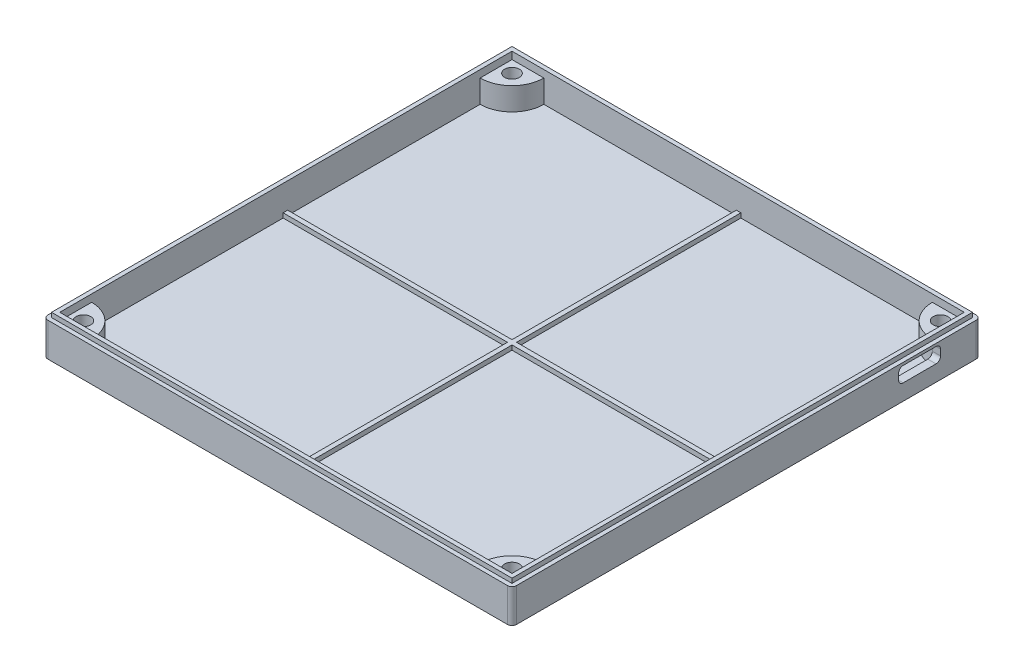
ISO-10303-21;
HEADER;
FILE_DESCRIPTION(('STEP AP214'),'2;1');
FILE_NAME('part.step','',(''),(''),'','','');
FILE_SCHEMA(('AUTOMOTIVE_DESIGN { 1 0 10303 214 1 1 1 1 }'));
ENDSEC;
DATA;
#1=APPLICATION_CONTEXT('core data for automotive mechanical design processes');
#2=APPLICATION_PROTOCOL_DEFINITION('international standard','automotive_design',2000,#1);
#3=PRODUCT_CONTEXT('',#1,'mechanical');
#4=PRODUCT('Part','Part','',(#3));
#5=PRODUCT_RELATED_PRODUCT_CATEGORY('part','',(#4));
#6=PRODUCT_DEFINITION_FORMATION('','',#4);
#7=PRODUCT_DEFINITION_CONTEXT('part definition',#1,'design');
#8=PRODUCT_DEFINITION('design','',#6,#7);
#9=PRODUCT_DEFINITION_SHAPE('','',#8);
#10=(LENGTH_UNIT() NAMED_UNIT(*) SI_UNIT(.MILLI.,.METRE.));
#11=(NAMED_UNIT(*) PLANE_ANGLE_UNIT() SI_UNIT($,.RADIAN.));
#12=(NAMED_UNIT(*) SI_UNIT($,.STERADIAN.) SOLID_ANGLE_UNIT());
#13=UNCERTAINTY_MEASURE_WITH_UNIT(LENGTH_MEASURE(1.E-05),#10,'distance_accuracy_value','');
#14=(GEOMETRIC_REPRESENTATION_CONTEXT(3) GLOBAL_UNCERTAINTY_ASSIGNED_CONTEXT((#13)) GLOBAL_UNIT_ASSIGNED_CONTEXT((#10,
#11,#12)) REPRESENTATION_CONTEXT('',''));
#15=CARTESIAN_POINT('',(0.,0.,0.));
#16=DIRECTION('',(0.,0.,1.));
#17=DIRECTION('',(1.,0.,0.));
#18=AXIS2_PLACEMENT_3D('',#15,#16,#17);
#19=CARTESIAN_POINT('',(0.,-0.4,0.));
#20=DIRECTION('',(0.,-1.,0.));
#21=DIRECTION('',(0.,0.,-1.));
#22=AXIS2_PLACEMENT_3D('',#19,#20,#21);
#23=PLANE('',#22);
#24=DIRECTION('',(0.867065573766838,0.,0.498194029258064));
#25=VECTOR('',#24,1.);
#26=CARTESIAN_POINT('',(98.3933820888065,-0.4,95.224580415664));
#27=LINE('',#26,#25);
#28=CARTESIAN_POINT('',(98.3933820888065,-0.4,95.224580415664));
#29=VERTEX_POINT('',#28);
#30=CARTESIAN_POINT('',(101.146685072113,-0.4,96.8065589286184));
#31=VERTEX_POINT('',#30);
#32=EDGE_CURVE('E64',#29,#31,#27,.T.);
#33=ORIENTED_EDGE('',*,*,#32,.F.);
#34=DIRECTION('',(0.86498147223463,0.,-0.50180379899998));
#35=VECTOR('',#34,1.);
#36=CARTESIAN_POINT('',(95.6466970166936,-0.4,96.8180214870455));
#37=LINE('',#36,#35);
#38=CARTESIAN_POINT('',(95.6466970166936,-0.4,96.8180214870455));
#39=VERTEX_POINT('',#38);
#40=EDGE_CURVE('E523',#39,#29,#37,.T.);
#41=ORIENTED_EDGE('',*,*,#40,.F.);
#42=DIRECTION('',(-0.00208410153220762,0.,-0.999997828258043));
#43=VECTOR('',#42,1.);
#44=CARTESIAN_POINT('',(95.6533149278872,-0.4,99.9934410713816));
#45=LINE('',#44,#43);
#46=CARTESIAN_POINT('',(95.6533149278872,-0.4,99.9934410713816));
#47=VERTEX_POINT('',#46);
#48=EDGE_CURVE('E549',#47,#39,#45,.T.);
#49=ORIENTED_EDGE('',*,*,#48,.F.);
#50=DIRECTION('',(-0.867065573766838,0.,-0.498194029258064));
#51=VECTOR('',#50,1.);
#52=CARTESIAN_POINT('',(98.4066179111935,-0.4,101.575419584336));
#53=LINE('',#52,#51);
#54=CARTESIAN_POINT('',(98.4066179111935,-0.4,101.575419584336));
#55=VERTEX_POINT('',#54);
#56=EDGE_CURVE('E546',#55,#47,#53,.T.);
#57=ORIENTED_EDGE('',*,*,#56,.F.);
#58=DIRECTION('',(-0.86498147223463,0.,0.501803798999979));
#59=VECTOR('',#58,1.);
#60=CARTESIAN_POINT('',(101.153302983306,-0.4,99.9819785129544));
#61=LINE('',#60,#59);
#62=CARTESIAN_POINT('',(101.153302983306,-0.4,99.9819785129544));
#63=VERTEX_POINT('',#62);
#64=EDGE_CURVE('E543',#63,#55,#61,.T.);
#65=ORIENTED_EDGE('',*,*,#64,.F.);
#66=DIRECTION('',(0.00208410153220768,0.,0.999997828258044));
#67=VECTOR('',#66,1.);
#68=CARTESIAN_POINT('',(101.146685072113,-0.4,96.8065589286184));
#69=LINE('',#68,#67);
#70=EDGE_CURVE('E540',#31,#63,#69,.T.);
#71=ORIENTED_EDGE('',*,*,#70,.F.);
#72=EDGE_LOOP('',(#33,#41,#49,#57,#65,#71));
#73=FACE_BOUND('',#72,.T.);
#74=DIRECTION('',(-0.867065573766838,0.,-0.498194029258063));
#75=VECTOR('',#74,1.);
#76=CARTESIAN_POINT('',(4.40661791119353,-0.4,7.57541958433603));
#77=LINE('',#76,#75);
#78=CARTESIAN_POINT('',(4.40661791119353,-0.4,7.57541958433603));
#79=VERTEX_POINT('',#78);
#80=CARTESIAN_POINT('',(1.65331492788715,-0.4,5.99344107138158));
#81=VERTEX_POINT('',#80);
#82=EDGE_CURVE('E757',#79,#81,#77,.T.);
#83=ORIENTED_EDGE('',*,*,#82,.F.);
#84=DIRECTION('',(-0.86498147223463,0.,0.50180379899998));
#85=VECTOR('',#84,1.);
#86=CARTESIAN_POINT('',(7.15330298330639,-0.4,5.98197851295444));
#87=LINE('',#86,#85);
#88=CARTESIAN_POINT('',(7.15330298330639,-0.4,5.98197851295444));
#89=VERTEX_POINT('',#88);
#90=EDGE_CURVE('E762',#89,#79,#87,.T.);
#91=ORIENTED_EDGE('',*,*,#90,.F.);
#92=DIRECTION('',(0.00208410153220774,0.,0.999997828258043));
#93=VECTOR('',#92,1.);
#94=CARTESIAN_POINT('',(7.14668507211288,-0.4,2.80655892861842));
#95=LINE('',#94,#93);
#96=CARTESIAN_POINT('',(7.14668507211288,-0.4,2.80655892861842));
#97=VERTEX_POINT('',#96);
#98=EDGE_CURVE('E788',#97,#89,#95,.T.);
#99=ORIENTED_EDGE('',*,*,#98,.F.);
#100=DIRECTION('',(0.867065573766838,0.,0.498194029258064));
#101=VECTOR('',#100,1.);
#102=CARTESIAN_POINT('',(4.3933820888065,-0.4,1.22458041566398));
#103=LINE('',#102,#101);
#104=CARTESIAN_POINT('',(4.3933820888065,-0.4,1.22458041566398));
#105=VERTEX_POINT('',#104);
#106=EDGE_CURVE('E785',#105,#97,#103,.T.);
#107=ORIENTED_EDGE('',*,*,#106,.F.);
#108=DIRECTION('',(0.86498147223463,0.,-0.50180379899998));
#109=VECTOR('',#108,1.);
#110=CARTESIAN_POINT('',(1.64669701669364,-0.4,2.81802148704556));
#111=LINE('',#110,#109);
#112=CARTESIAN_POINT('',(1.64669701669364,-0.4,2.81802148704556));
#113=VERTEX_POINT('',#112);
#114=EDGE_CURVE('E782',#113,#105,#111,.T.);
#115=ORIENTED_EDGE('',*,*,#114,.F.);
#116=DIRECTION('',(-0.0020841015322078,0.,-0.999997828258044));
#117=VECTOR('',#116,1.);
#118=CARTESIAN_POINT('',(1.65331492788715,-0.4,5.99344107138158));
#119=LINE('',#118,#117);
#120=EDGE_CURVE('E779',#81,#113,#119,.T.);
#121=ORIENTED_EDGE('',*,*,#120,.F.);
#122=EDGE_LOOP('',(#83,#91,#99,#107,#115,#121));
#123=FACE_BOUND('',#122,.T.);
#124=DIRECTION('',(0.,0.,-1.));
#125=VECTOR('',#124,1.);
#126=CARTESIAN_POINT('',(0.,-0.4,0.));
#127=LINE('',#126,#125);
#128=CARTESIAN_POINT('',(0.,-0.4,101.8));
#129=VERTEX_POINT('',#128);
#130=CARTESIAN_POINT('',(0.,-0.4,1.));
#131=VERTEX_POINT('',#130);
#132=EDGE_CURVE('E828',#129,#131,#127,.T.);
#133=ORIENTED_EDGE('',*,*,#132,.T.);
#134=CARTESIAN_POINT('',(1.,-0.399999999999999,1.));
#135=DIRECTION('',(0.,-1.,0.));
#136=DIRECTION('',(0.,0.,-1.));
#137=AXIS2_PLACEMENT_3D('',#134,#135,#136);
#138=CIRCLE('',#137,1.);
#139=CARTESIAN_POINT('',(1.,-0.4,0.));
#140=VERTEX_POINT('',#139);
#141=EDGE_CURVE('E980',#131,#140,#138,.T.);
#142=ORIENTED_EDGE('',*,*,#141,.T.);
#143=DIRECTION('',(1.,0.,0.));
#144=VECTOR('',#143,1.);
#145=CARTESIAN_POINT('',(102.8,-0.4,0.));
#146=LINE('',#145,#144);
#147=CARTESIAN_POINT('',(101.8,-0.4,0.));
#148=VERTEX_POINT('',#147);
#149=EDGE_CURVE('E831',#140,#148,#146,.T.);
#150=ORIENTED_EDGE('',*,*,#149,.T.);
#151=CARTESIAN_POINT('',(101.8,-0.399999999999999,1.));
#152=DIRECTION('',(0.,-1.,0.));
#153=DIRECTION('',(0.,0.,-1.));
#154=AXIS2_PLACEMENT_3D('',#151,#152,#153);
#155=CIRCLE('',#154,1.);
#156=CARTESIAN_POINT('',(102.8,-0.4,0.999999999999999));
#157=VERTEX_POINT('',#156);
#158=EDGE_CURVE('E978',#148,#157,#155,.T.);
#159=ORIENTED_EDGE('',*,*,#158,.T.);
#160=DIRECTION('',(0.,0.,1.));
#161=VECTOR('',#160,1.);
#162=CARTESIAN_POINT('',(102.8,-0.4,0.));
#163=LINE('',#162,#161);
#164=CARTESIAN_POINT('',(102.8,-0.4,101.8));
#165=VERTEX_POINT('',#164);
#166=EDGE_CURVE('E822',#157,#165,#163,.T.);
#167=ORIENTED_EDGE('',*,*,#166,.T.);
#168=CARTESIAN_POINT('',(101.8,-0.399999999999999,101.8));
#169=DIRECTION('',(0.,-1.,0.));
#170=DIRECTION('',(0.,0.,-1.));
#171=AXIS2_PLACEMENT_3D('',#168,#169,#170);
#172=CIRCLE('',#171,1.);
#173=CARTESIAN_POINT('',(101.8,-0.4,102.8));
#174=VERTEX_POINT('',#173);
#175=EDGE_CURVE('E976',#165,#174,#172,.T.);
#176=ORIENTED_EDGE('',*,*,#175,.T.);
#177=DIRECTION('',(-1.,0.,0.));
#178=VECTOR('',#177,1.);
#179=CARTESIAN_POINT('',(102.8,-0.4,102.8));
#180=LINE('',#179,#178);
#181=CARTESIAN_POINT('',(1.00000000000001,-0.4,102.8));
#182=VERTEX_POINT('',#181);
#183=EDGE_CURVE('E825',#174,#182,#180,.T.);
#184=ORIENTED_EDGE('',*,*,#183,.T.);
#185=CARTESIAN_POINT('',(1.00000000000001,-0.399999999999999,101.8));
#186=DIRECTION('',(0.,-1.,0.));
#187=DIRECTION('',(0.,0.,-1.));
#188=AXIS2_PLACEMENT_3D('',#185,#186,#187);
#189=CIRCLE('',#188,1.);
#190=EDGE_CURVE('E974',#182,#129,#189,.T.);
#191=ORIENTED_EDGE('',*,*,#190,.T.);
#192=EDGE_LOOP('',(#133,#142,#150,#159,#167,#176,#184,#191));
#193=FACE_BOUND('',#192,.T.);
#194=DIRECTION('',(0.86498147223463,0.,0.50180379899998));
#195=VECTOR('',#194,1.);
#196=CARTESIAN_POINT('',(95.6466970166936,-0.4,5.98197851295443));
#197=LINE('',#196,#195);
#198=CARTESIAN_POINT('',(95.6466970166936,-0.4,5.98197851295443));
#199=VERTEX_POINT('',#198);
#200=CARTESIAN_POINT('',(98.3933820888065,-0.4,7.57541958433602));
#201=VERTEX_POINT('',#200);
#202=EDGE_CURVE('E710',#199,#201,#197,.T.);
#203=ORIENTED_EDGE('',*,*,#202,.T.);
#204=DIRECTION('',(0.867065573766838,0.,-0.498194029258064));
#205=VECTOR('',#204,1.);
#206=CARTESIAN_POINT('',(98.3933820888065,-0.4,7.57541958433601));
#207=LINE('',#206,#205);
#208=CARTESIAN_POINT('',(101.146685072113,-0.4,5.99344107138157));
#209=VERTEX_POINT('',#208);
#210=EDGE_CURVE('E707',#201,#209,#207,.T.);
#211=ORIENTED_EDGE('',*,*,#210,.T.);
#212=DIRECTION('',(0.00208410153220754,0.,-0.999997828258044));
#213=VECTOR('',#212,1.);
#214=CARTESIAN_POINT('',(101.146685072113,-0.4,5.99344107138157));
#215=LINE('',#214,#213);
#216=CARTESIAN_POINT('',(101.153302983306,-0.4,2.81802148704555));
#217=VERTEX_POINT('',#216);
#218=EDGE_CURVE('E696',#209,#217,#215,.T.);
#219=ORIENTED_EDGE('',*,*,#218,.T.);
#220=DIRECTION('',(-0.86498147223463,0.,-0.501803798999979));
#221=VECTOR('',#220,1.);
#222=CARTESIAN_POINT('',(101.153302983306,-0.4,2.81802148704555));
#223=LINE('',#222,#221);
#224=CARTESIAN_POINT('',(98.4066179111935,-0.4,1.22458041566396));
#225=VERTEX_POINT('',#224);
#226=EDGE_CURVE('E719',#217,#225,#223,.T.);
#227=ORIENTED_EDGE('',*,*,#226,.T.);
#228=DIRECTION('',(-0.867065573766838,0.,0.498194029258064));
#229=VECTOR('',#228,1.);
#230=CARTESIAN_POINT('',(98.4066179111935,-0.4,1.22458041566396));
#231=LINE('',#230,#229);
#232=CARTESIAN_POINT('',(95.6533149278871,-0.4,2.80655892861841));
#233=VERTEX_POINT('',#232);
#234=EDGE_CURVE('E716',#225,#233,#231,.T.);
#235=ORIENTED_EDGE('',*,*,#234,.T.);
#236=DIRECTION('',(-0.00208410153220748,0.,0.999997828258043));
#237=VECTOR('',#236,1.);
#238=CARTESIAN_POINT('',(95.6533149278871,-0.4,2.80655892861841));
#239=LINE('',#238,#237);
#240=EDGE_CURVE('E713',#233,#199,#239,.T.);
#241=ORIENTED_EDGE('',*,*,#240,.T.);
#242=EDGE_LOOP('',(#203,#211,#219,#227,#235,#241));
#243=FACE_BOUND('',#242,.T.);
#244=DIRECTION('',(-0.86498147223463,0.,-0.50180379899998));
#245=VECTOR('',#244,1.);
#246=CARTESIAN_POINT('',(7.1533029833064,-0.4,96.8180214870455));
#247=LINE('',#246,#245);
#248=CARTESIAN_POINT('',(7.1533029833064,-0.4,96.8180214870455));
#249=VERTEX_POINT('',#248);
#250=CARTESIAN_POINT('',(4.40661791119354,-0.4,95.224580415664));
#251=VERTEX_POINT('',#250);
#252=EDGE_CURVE('E500',#249,#251,#247,.T.);
#253=ORIENTED_EDGE('',*,*,#252,.T.);
#254=DIRECTION('',(-0.867065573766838,0.,0.498194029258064));
#255=VECTOR('',#254,1.);
#256=CARTESIAN_POINT('',(4.40661791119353,-0.4,95.224580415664));
#257=LINE('',#256,#255);
#258=CARTESIAN_POINT('',(1.65331492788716,-0.4,96.8065589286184));
#259=VERTEX_POINT('',#258);
#260=EDGE_CURVE('E56',#251,#259,#257,.T.);
#261=ORIENTED_EDGE('',*,*,#260,.T.);
#262=DIRECTION('',(-0.00208410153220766,0.,0.999997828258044));
#263=VECTOR('',#262,1.);
#264=CARTESIAN_POINT('',(1.65331492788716,-0.4,96.8065589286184));
#265=LINE('',#264,#263);
#266=CARTESIAN_POINT('',(1.64669701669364,-0.4,99.9819785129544));
#267=VERTEX_POINT('',#266);
#268=EDGE_CURVE('E487',#259,#267,#265,.T.);
#269=ORIENTED_EDGE('',*,*,#268,.T.);
#270=DIRECTION('',(0.86498147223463,0.,0.501803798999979));
#271=VECTOR('',#270,1.);
#272=CARTESIAN_POINT('',(1.64669701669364,-0.4,99.9819785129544));
#273=LINE('',#272,#271);
#274=CARTESIAN_POINT('',(4.39338208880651,-0.4,101.575419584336));
#275=VERTEX_POINT('',#274);
#276=EDGE_CURVE('E490',#267,#275,#273,.T.);
#277=ORIENTED_EDGE('',*,*,#276,.T.);
#278=DIRECTION('',(0.867065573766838,0.,-0.498194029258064));
#279=VECTOR('',#278,1.);
#280=CARTESIAN_POINT('',(4.39338208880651,-0.4,101.575419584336));
#281=LINE('',#280,#279);
#282=CARTESIAN_POINT('',(7.14668507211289,-0.4,99.9934410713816));
#283=VERTEX_POINT('',#282);
#284=EDGE_CURVE('E505',#275,#283,#281,.T.);
#285=ORIENTED_EDGE('',*,*,#284,.T.);
#286=DIRECTION('',(0.0020841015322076,0.,-0.999997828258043));
#287=VECTOR('',#286,1.);
#288=CARTESIAN_POINT('',(7.14668507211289,-0.4,99.9934410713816));
#289=LINE('',#288,#287);
#290=EDGE_CURVE('E502',#283,#249,#289,.T.);
#291=ORIENTED_EDGE('',*,*,#290,.T.);
#292=EDGE_LOOP('',(#253,#261,#269,#277,#285,#291));
#293=FACE_BOUND('',#292,.T.);
#294=ADVANCED_FACE('F39',(#73,#123,#193,#243,#293),#23,.T.);
#295=CARTESIAN_POINT('',(4.40000000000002,6.4,98.4));
#296=DIRECTION('',(0.,-1.,0.));
#297=DIRECTION('',(0.,0.,-1.));
#298=AXIS2_PLACEMENT_3D('',#295,#296,#297);
#299=CYLINDRICAL_SURFACE('',#298,1.6);
#300=CARTESIAN_POINT('',(4.40000000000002,6.4,98.4));
#301=DIRECTION('',(0.,-1.,0.));
#302=DIRECTION('',(0.,0.,-1.));
#303=AXIS2_PLACEMENT_3D('',#300,#301,#302);
#304=CIRCLE('',#303,1.6);
#305=CARTESIAN_POINT('',(4.40000000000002,6.4,96.8));
#306=VERTEX_POINT('',#305);
#307=EDGE_CURVE('E582',#306,#306,#304,.T.);
#308=ORIENTED_EDGE('',*,*,#307,.F.);
#309=EDGE_LOOP('',(#308));
#310=FACE_BOUND('',#309,.T.);
#311=CARTESIAN_POINT('',(4.40000000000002,2.1,98.4));
#312=DIRECTION('',(0.,-1.,0.));
#313=DIRECTION('',(0.,0.,-1.));
#314=AXIS2_PLACEMENT_3D('',#311,#312,#313);
#315=CIRCLE('',#314,1.6);
#316=CARTESIAN_POINT('',(4.40000000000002,2.1,96.8));
#317=VERTEX_POINT('',#316);
#318=EDGE_CURVE('E43',#317,#317,#315,.F.);
#319=ORIENTED_EDGE('',*,*,#318,.F.);
#320=EDGE_LOOP('',(#319));
#321=FACE_BOUND('',#320,.T.);
#322=ADVANCED_FACE('F1035',(#310,#321),#299,.F.);
#323=CARTESIAN_POINT('',(98.4,6.4,98.4));
#324=DIRECTION('',(0.,-1.,0.));
#325=DIRECTION('',(0.,0.,-1.));
#326=AXIS2_PLACEMENT_3D('',#323,#324,#325);
#327=CYLINDRICAL_SURFACE('',#326,1.6);
#328=CARTESIAN_POINT('',(98.4,6.4,98.4));
#329=DIRECTION('',(0.,1.,0.));
#330=DIRECTION('',(0.,0.,-1.));
#331=AXIS2_PLACEMENT_3D('',#328,#329,#330);
#332=CIRCLE('',#331,1.6);
#333=CARTESIAN_POINT('',(98.4,6.4,96.8));
#334=VERTEX_POINT('',#333);
#335=EDGE_CURVE('E566',#334,#334,#332,.T.);
#336=ORIENTED_EDGE('',*,*,#335,.T.);
#337=EDGE_LOOP('',(#336));
#338=FACE_BOUND('',#337,.T.);
#339=CARTESIAN_POINT('',(98.4,2.1,98.4));
#340=DIRECTION('',(0.,-1.,0.));
#341=DIRECTION('',(0.,0.,-1.));
#342=AXIS2_PLACEMENT_3D('',#339,#340,#341);
#343=CIRCLE('',#342,1.6);
#344=CARTESIAN_POINT('',(98.4,2.1,96.8));
#345=VERTEX_POINT('',#344);
#346=EDGE_CURVE('E556',#345,#345,#343,.T.);
#347=ORIENTED_EDGE('',*,*,#346,.T.);
#348=EDGE_LOOP('',(#347));
#349=FACE_BOUND('',#348,.T.);
#350=ADVANCED_FACE('F1004',(#338,#349),#327,.F.);
#351=CARTESIAN_POINT('',(0.,8.,0.));
#352=DIRECTION('',(1.,0.,0.));
#353=DIRECTION('',(0.,0.,-1.));
#354=AXIS2_PLACEMENT_3D('',#351,#352,#353);
#355=PLANE('',#354);
#356=DIRECTION('',(0.,0.,1.));
#357=VECTOR('',#356,1.);
#358=CARTESIAN_POINT('',(0.,7.,0.));
#359=LINE('',#358,#357);
#360=CARTESIAN_POINT('',(0.,7.,1.));
#361=VERTEX_POINT('',#360);
#362=CARTESIAN_POINT('',(0.,7.,101.8));
#363=VERTEX_POINT('',#362);
#364=EDGE_CURVE('E627',#361,#363,#359,.T.);
#365=ORIENTED_EDGE('',*,*,#364,.F.);
#366=DIRECTION('',(0.,-1.,0.));
#367=VECTOR('',#366,1.);
#368=CARTESIAN_POINT('',(0.,8.,1.));
#369=LINE('',#368,#367);
#370=EDGE_CURVE('E971',#361,#131,#369,.T.);
#371=ORIENTED_EDGE('',*,*,#370,.T.);
#372=ORIENTED_EDGE('',*,*,#132,.F.);
#373=DIRECTION('',(0.,-1.,0.));
#374=VECTOR('',#373,1.);
#375=CARTESIAN_POINT('',(0.,8.,101.8));
#376=LINE('',#375,#374);
#377=EDGE_CURVE('E969',#129,#363,#376,.F.);
#378=ORIENTED_EDGE('',*,*,#377,.T.);
#379=EDGE_LOOP('',(#365,#371,#372,#378));
#380=FACE_BOUND('',#379,.T.);
#381=ADVANCED_FACE('F1091',(#380),#355,.F.);
#382=CARTESIAN_POINT('',(0.,8.,102.8));
#383=DIRECTION('',(0.,0.,-1.));
#384=DIRECTION('',(-1.,0.,0.));
#385=AXIS2_PLACEMENT_3D('',#382,#383,#384);
#386=PLANE('',#385);
#387=ORIENTED_EDGE('',*,*,#183,.F.);
#388=DIRECTION('',(0.,-1.,0.));
#389=VECTOR('',#388,1.);
#390=CARTESIAN_POINT('',(101.8,8.,102.8));
#391=LINE('',#390,#389);
#392=CARTESIAN_POINT('',(101.8,7.,102.8));
#393=VERTEX_POINT('',#392);
#394=EDGE_CURVE('E12',#174,#393,#391,.F.);
#395=ORIENTED_EDGE('',*,*,#394,.T.);
#396=DIRECTION('',(1.,0.,0.));
#397=VECTOR('',#396,1.);
#398=CARTESIAN_POINT('',(0.,7.,102.8));
#399=LINE('',#398,#397);
#400=CARTESIAN_POINT('',(1.00000000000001,7.,102.8));
#401=VERTEX_POINT('',#400);
#402=EDGE_CURVE('E636',#401,#393,#399,.T.);
#403=ORIENTED_EDGE('',*,*,#402,.F.);
#404=DIRECTION('',(0.,-1.,0.));
#405=VECTOR('',#404,1.);
#406=CARTESIAN_POINT('',(1.00000000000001,8.,102.8));
#407=LINE('',#406,#405);
#408=EDGE_CURVE('E48',#401,#182,#407,.T.);
#409=ORIENTED_EDGE('',*,*,#408,.T.);
#410=EDGE_LOOP('',(#387,#395,#403,#409));
#411=FACE_BOUND('',#410,.T.);
#412=ADVANCED_FACE('F1313',(#411),#386,.F.);
#413=CARTESIAN_POINT('',(102.8,8.,0.));
#414=DIRECTION('',(-1.,0.,0.));
#415=DIRECTION('',(0.,0.,1.));
#416=AXIS2_PLACEMENT_3D('',#413,#414,#415);
#417=PLANE('',#416);
#418=DIRECTION('',(0.,0.,1.));
#419=VECTOR('',#418,1.);
#420=CARTESIAN_POINT('',(102.8,3.1,0.));
#421=LINE('',#420,#419);
#422=CARTESIAN_POINT('',(102.8,3.1,9.8));
#423=VERTEX_POINT('',#422);
#424=CARTESIAN_POINT('',(102.8,3.1,17.));
#425=VERTEX_POINT('',#424);
#426=EDGE_CURVE('E943',#423,#425,#421,.T.);
#427=ORIENTED_EDGE('',*,*,#426,.T.);
#428=CARTESIAN_POINT('',(102.8,4.1,17.));
#429=DIRECTION('',(1.,0.,0.));
#430=DIRECTION('',(0.,0.,-1.));
#431=AXIS2_PLACEMENT_3D('',#428,#429,#430);
#432=CIRCLE('',#431,1.);
#433=CARTESIAN_POINT('',(102.8,4.1,18.));
#434=VERTEX_POINT('',#433);
#435=EDGE_CURVE('E966',#425,#434,#432,.F.);
#436=ORIENTED_EDGE('',*,*,#435,.T.);
#437=DIRECTION('',(0.,1.,0.));
#438=VECTOR('',#437,1.);
#439=CARTESIAN_POINT('',(102.8,8.,18.));
#440=LINE('',#439,#438);
#441=CARTESIAN_POINT('',(102.8,5.4,18.));
#442=VERTEX_POINT('',#441);
#443=EDGE_CURVE('E963',#434,#442,#440,.T.);
#444=ORIENTED_EDGE('',*,*,#443,.T.);
#445=CARTESIAN_POINT('',(102.8,5.4,17.));
#446=DIRECTION('',(1.,0.,0.));
#447=DIRECTION('',(0.,0.,-1.));
#448=AXIS2_PLACEMENT_3D('',#445,#446,#447);
#449=CIRCLE('',#448,1.);
#450=CARTESIAN_POINT('',(102.8,6.4,17.));
#451=VERTEX_POINT('',#450);
#452=EDGE_CURVE('E960',#442,#451,#449,.F.);
#453=ORIENTED_EDGE('',*,*,#452,.T.);
#454=DIRECTION('',(0.,0.,1.));
#455=VECTOR('',#454,1.);
#456=CARTESIAN_POINT('',(102.8,6.4,0.));
#457=LINE('',#456,#455);
#458=CARTESIAN_POINT('',(102.8,6.4,9.8));
#459=VERTEX_POINT('',#458);
#460=EDGE_CURVE('E957',#451,#459,#457,.F.);
#461=ORIENTED_EDGE('',*,*,#460,.T.);
#462=CARTESIAN_POINT('',(102.8,5.4,9.8));
#463=DIRECTION('',(1.,0.,0.));
#464=DIRECTION('',(0.,0.,-1.));
#465=AXIS2_PLACEMENT_3D('',#462,#463,#464);
#466=CIRCLE('',#465,1.);
#467=CARTESIAN_POINT('',(102.8,5.4,8.8));
#468=VERTEX_POINT('',#467);
#469=EDGE_CURVE('E953',#459,#468,#466,.F.);
#470=ORIENTED_EDGE('',*,*,#469,.T.);
#471=DIRECTION('',(0.,1.,0.));
#472=VECTOR('',#471,1.);
#473=CARTESIAN_POINT('',(102.8,5.39999999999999,8.8));
#474=LINE('',#473,#472);
#475=CARTESIAN_POINT('',(102.8,4.1,8.8));
#476=VERTEX_POINT('',#475);
#477=EDGE_CURVE('E661',#476,#468,#474,.T.);
#478=ORIENTED_EDGE('',*,*,#477,.F.);
#479=CARTESIAN_POINT('',(102.8,4.1,9.8));
#480=DIRECTION('',(1.,0.,0.));
#481=DIRECTION('',(0.,0.,-1.));
#482=AXIS2_PLACEMENT_3D('',#479,#480,#481);
#483=CIRCLE('',#482,0.999999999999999);
#484=EDGE_CURVE('E950',#476,#423,#483,.F.);
#485=ORIENTED_EDGE('',*,*,#484,.T.);
#486=EDGE_LOOP('',(#427,#436,#444,#453,#461,#470,#478,#485));
#487=FACE_BOUND('',#486,.T.);
#488=ORIENTED_EDGE('',*,*,#166,.F.);
#489=DIRECTION('',(0.,-1.,0.));
#490=VECTOR('',#489,1.);
#491=CARTESIAN_POINT('',(102.8,8.,1.));
#492=LINE('',#491,#490);
#493=CARTESIAN_POINT('',(102.8,7.,0.999999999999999));
#494=VERTEX_POINT('',#493);
#495=EDGE_CURVE('E998',#157,#494,#492,.F.);
#496=ORIENTED_EDGE('',*,*,#495,.T.);
#497=DIRECTION('',(0.,0.,-1.));
#498=VECTOR('',#497,1.);
#499=CARTESIAN_POINT('',(102.8,7.,0.));
#500=LINE('',#499,#498);
#501=CARTESIAN_POINT('',(102.8,7.,101.8));
#502=VERTEX_POINT('',#501);
#503=EDGE_CURVE('E639',#502,#494,#500,.T.);
#504=ORIENTED_EDGE('',*,*,#503,.F.);
#505=DIRECTION('',(0.,-1.,0.));
#506=VECTOR('',#505,1.);
#507=CARTESIAN_POINT('',(102.8,8.,101.8));
#508=LINE('',#507,#506);
#509=EDGE_CURVE('E995',#502,#165,#508,.T.);
#510=ORIENTED_EDGE('',*,*,#509,.T.);
#511=EDGE_LOOP('',(#488,#496,#504,#510));
#512=FACE_BOUND('',#511,.T.);
#513=ADVANCED_FACE('F1309',(#487,#512),#417,.F.);
#514=CARTESIAN_POINT('',(0.,8.,0.));
#515=DIRECTION('',(0.,0.,1.));
#516=DIRECTION('',(1.,0.,0.));
#517=AXIS2_PLACEMENT_3D('',#514,#515,#516);
#518=PLANE('',#517);
#519=ORIENTED_EDGE('',*,*,#149,.F.);
#520=DIRECTION('',(0.,-1.,0.));
#521=VECTOR('',#520,1.);
#522=CARTESIAN_POINT('',(1.,8.,0.));
#523=LINE('',#522,#521);
#524=CARTESIAN_POINT('',(1.,7.,0.));
#525=VERTEX_POINT('',#524);
#526=EDGE_CURVE('E985',#140,#525,#523,.F.);
#527=ORIENTED_EDGE('',*,*,#526,.T.);
#528=DIRECTION('',(-1.,0.,0.));
#529=VECTOR('',#528,1.);
#530=CARTESIAN_POINT('',(0.,7.,0.));
#531=LINE('',#530,#529);
#532=CARTESIAN_POINT('',(101.8,7.,0.));
#533=VERTEX_POINT('',#532);
#534=EDGE_CURVE('E642',#533,#525,#531,.T.);
#535=ORIENTED_EDGE('',*,*,#534,.F.);
#536=DIRECTION('',(0.,-1.,0.));
#537=VECTOR('',#536,1.);
#538=CARTESIAN_POINT('',(101.8,8.,0.));
#539=LINE('',#538,#537);
#540=EDGE_CURVE('E982',#533,#148,#539,.T.);
#541=ORIENTED_EDGE('',*,*,#540,.T.);
#542=EDGE_LOOP('',(#519,#527,#535,#541));
#543=FACE_BOUND('',#542,.T.);
#544=ADVANCED_FACE('F1305',(#543),#518,.F.);
#545=CARTESIAN_POINT('',(0.,8.,0.));
#546=DIRECTION('',(0.,1.,0.));
#547=DIRECTION('',(0.,0.,1.));
#548=AXIS2_PLACEMENT_3D('',#545,#546,#547);
#549=PLANE('',#548);
#550=DIRECTION('',(0.,0.,1.));
#551=VECTOR('',#550,1.);
#552=CARTESIAN_POINT('',(1.8,8.,1.8));
#553=LINE('',#552,#551);
#554=CARTESIAN_POINT('',(1.8,8.,1.8));
#555=VERTEX_POINT('',#554);
#556=CARTESIAN_POINT('',(1.80000000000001,8.,101.));
#557=VERTEX_POINT('',#556);
#558=EDGE_CURVE('E911',#555,#557,#553,.T.);
#559=ORIENTED_EDGE('',*,*,#558,.F.);
#560=DIRECTION('',(-1.,0.,0.));
#561=VECTOR('',#560,1.);
#562=CARTESIAN_POINT('',(1.8,8.,1.8));
#563=LINE('',#562,#561);
#564=CARTESIAN_POINT('',(101.,8.,1.8));
#565=VERTEX_POINT('',#564);
#566=EDGE_CURVE('E930',#565,#555,#563,.T.);
#567=ORIENTED_EDGE('',*,*,#566,.F.);
#568=DIRECTION('',(0.,0.,-1.));
#569=VECTOR('',#568,1.);
#570=CARTESIAN_POINT('',(101.,8.,1.8));
#571=LINE('',#570,#569);
#572=CARTESIAN_POINT('',(101.,8.,101.));
#573=VERTEX_POINT('',#572);
#574=EDGE_CURVE('E927',#573,#565,#571,.T.);
#575=ORIENTED_EDGE('',*,*,#574,.F.);
#576=DIRECTION('',(1.,0.,0.));
#577=VECTOR('',#576,1.);
#578=CARTESIAN_POINT('',(1.80000000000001,8.,101.));
#579=LINE('',#578,#577);
#580=EDGE_CURVE('E924',#557,#573,#579,.T.);
#581=ORIENTED_EDGE('',*,*,#580,.F.);
#582=EDGE_LOOP('',(#559,#567,#575,#581));
#583=FACE_BOUND('',#582,.T.);
#584=DIRECTION('',(-1.,0.,0.));
#585=VECTOR('',#584,1.);
#586=CARTESIAN_POINT('',(0.9,8.,0.9));
#587=LINE('',#586,#585);
#588=CARTESIAN_POINT('',(101.9,8.,0.9));
#589=VERTEX_POINT('',#588);
#590=CARTESIAN_POINT('',(0.9,8.,0.9));
#591=VERTEX_POINT('',#590);
#592=EDGE_CURVE('E605',#589,#591,#587,.T.);
#593=ORIENTED_EDGE('',*,*,#592,.T.);
#594=DIRECTION('',(0.,0.,1.));
#595=VECTOR('',#594,1.);
#596=CARTESIAN_POINT('',(0.9,8.,0.9));
#597=LINE('',#596,#595);
#598=CARTESIAN_POINT('',(0.900000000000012,8.,101.9));
#599=VERTEX_POINT('',#598);
#600=EDGE_CURVE('E600',#591,#599,#597,.T.);
#601=ORIENTED_EDGE('',*,*,#600,.T.);
#602=DIRECTION('',(1.,0.,0.));
#603=VECTOR('',#602,1.);
#604=CARTESIAN_POINT('',(0.900000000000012,8.,101.9));
#605=LINE('',#604,#603);
#606=CARTESIAN_POINT('',(101.9,8.,101.9));
#607=VERTEX_POINT('',#606);
#608=EDGE_CURVE('E617',#599,#607,#605,.T.);
#609=ORIENTED_EDGE('',*,*,#608,.T.);
#610=DIRECTION('',(0.,0.,-1.));
#611=VECTOR('',#610,1.);
#612=CARTESIAN_POINT('',(101.9,8.,0.9));
#613=LINE('',#612,#611);
#614=EDGE_CURVE('E620',#607,#589,#613,.T.);
#615=ORIENTED_EDGE('',*,*,#614,.T.);
#616=EDGE_LOOP('',(#593,#601,#609,#615));
#617=FACE_BOUND('',#616,.T.);
#618=ADVANCED_FACE('F1197',(#583,#617),#549,.T.);
#619=CARTESIAN_POINT('',(98.4,6.4,4.39999999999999));
#620=DIRECTION('',(0.,-1.,0.));
#621=DIRECTION('',(0.,0.,-1.));
#622=AXIS2_PLACEMENT_3D('',#619,#620,#621);
#623=CYLINDRICAL_SURFACE('',#622,1.6);
#624=CARTESIAN_POINT('',(98.4,6.4,4.39999999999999));
#625=DIRECTION('',(0.,-1.,0.));
#626=DIRECTION('',(0.,0.,1.));
#627=AXIS2_PLACEMENT_3D('',#624,#625,#626);
#628=CIRCLE('',#627,1.6);
#629=CARTESIAN_POINT('',(98.4,6.4,5.99999999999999));
#630=VERTEX_POINT('',#629);
#631=EDGE_CURVE('E738',#630,#630,#628,.T.);
#632=ORIENTED_EDGE('',*,*,#631,.F.);
#633=EDGE_LOOP('',(#632));
#634=FACE_BOUND('',#633,.T.);
#635=CARTESIAN_POINT('',(98.4,2.1,4.39999999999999));
#636=DIRECTION('',(0.,-1.,0.));
#637=DIRECTION('',(0.,0.,-1.));
#638=AXIS2_PLACEMENT_3D('',#635,#636,#637);
#639=CIRCLE('',#638,1.6);
#640=CARTESIAN_POINT('',(98.4,2.1,2.79999999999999));
#641=VERTEX_POINT('',#640);
#642=EDGE_CURVE('E727',#641,#641,#639,.F.);
#643=ORIENTED_EDGE('',*,*,#642,.F.);
#644=EDGE_LOOP('',(#643));
#645=FACE_BOUND('',#644,.T.);
#646=ADVANCED_FACE('F1193',(#634,#645),#623,.F.);
#647=CARTESIAN_POINT('',(4.40000000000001,6.4,4.4));
#648=DIRECTION('',(0.,-1.,0.));
#649=DIRECTION('',(0.,0.,-1.));
#650=AXIS2_PLACEMENT_3D('',#647,#648,#649);
#651=CYLINDRICAL_SURFACE('',#650,1.6);
#652=CARTESIAN_POINT('',(4.40000000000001,6.4,4.4));
#653=DIRECTION('',(0.,1.,0.));
#654=DIRECTION('',(0.,0.,1.));
#655=AXIS2_PLACEMENT_3D('',#652,#653,#654);
#656=CIRCLE('',#655,1.6);
#657=CARTESIAN_POINT('',(4.40000000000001,6.4,6.));
#658=VERTEX_POINT('',#657);
#659=EDGE_CURVE('E806',#658,#658,#656,.T.);
#660=ORIENTED_EDGE('',*,*,#659,.T.);
#661=EDGE_LOOP('',(#660));
#662=FACE_BOUND('',#661,.T.);
#663=CARTESIAN_POINT('',(4.40000000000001,2.1,4.4));
#664=DIRECTION('',(0.,-1.,0.));
#665=DIRECTION('',(0.,0.,-1.));
#666=AXIS2_PLACEMENT_3D('',#663,#664,#665);
#667=CIRCLE('',#666,1.6);
#668=CARTESIAN_POINT('',(4.40000000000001,2.1,2.8));
#669=VERTEX_POINT('',#668);
#670=EDGE_CURVE('E795',#669,#669,#667,.T.);
#671=ORIENTED_EDGE('',*,*,#670,.T.);
#672=EDGE_LOOP('',(#671));
#673=FACE_BOUND('',#672,.T.);
#674=ADVANCED_FACE('F1196',(#662,#673),#651,.F.);
#675=CARTESIAN_POINT('',(1.8,-140.289985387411,1.8));
#676=DIRECTION('',(-1.,0.,0.));
#677=DIRECTION('',(0.,0.,1.));
#678=AXIS2_PLACEMENT_3D('',#675,#676,#677);
#679=PLANE('',#678);
#680=DIRECTION('',(0.,0.,-1.));
#681=VECTOR('',#680,1.);
#682=CARTESIAN_POINT('',(1.80000000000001,6.4,101.));
#683=LINE('',#682,#681);
#684=CARTESIAN_POINT('',(1.80000000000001,6.39999999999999,101.));
#685=VERTEX_POINT('',#684);
#686=CARTESIAN_POINT('',(1.80000000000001,6.39999999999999,94.));
#687=VERTEX_POINT('',#686);
#688=EDGE_CURVE('E591',#685,#687,#683,.T.);
#689=ORIENTED_EDGE('',*,*,#688,.T.);
#690=DIRECTION('',(0.,-1.,0.));
#691=VECTOR('',#690,1.);
#692=CARTESIAN_POINT('',(1.80000000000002,6.4,94.));
#693=LINE('',#692,#691);
#694=CARTESIAN_POINT('',(1.80000000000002,1.4,94.));
#695=VERTEX_POINT('',#694);
#696=EDGE_CURVE('E593',#687,#695,#693,.T.);
#697=ORIENTED_EDGE('',*,*,#696,.T.);
#698=DIRECTION('',(0.,0.,-1.));
#699=VECTOR('',#698,1.);
#700=CARTESIAN_POINT('',(1.8,1.40000000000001,1.8));
#701=LINE('',#700,#699);
#702=CARTESIAN_POINT('',(1.80000000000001,1.4,52.));
#703=VERTEX_POINT('',#702);
#704=EDGE_CURVE('E919',#695,#703,#701,.T.);
#705=ORIENTED_EDGE('',*,*,#704,.T.);
#706=DIRECTION('',(0.,-1.,0.));
#707=VECTOR('',#706,1.);
#708=CARTESIAN_POINT('',(1.80000000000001,2.4,52.));
#709=LINE('',#708,#707);
#710=CARTESIAN_POINT('',(1.80000000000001,2.4,52.));
#711=VERTEX_POINT('',#710);
#712=EDGE_CURVE('E903',#711,#703,#709,.T.);
#713=ORIENTED_EDGE('',*,*,#712,.F.);
#714=DIRECTION('',(0.,0.,1.));
#715=VECTOR('',#714,1.);
#716=CARTESIAN_POINT('',(1.80000000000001,2.4,51.));
#717=LINE('',#716,#715);
#718=CARTESIAN_POINT('',(1.80000000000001,2.4,51.));
#719=VERTEX_POINT('',#718);
#720=EDGE_CURVE('E841',#719,#711,#717,.T.);
#721=ORIENTED_EDGE('',*,*,#720,.F.);
#722=DIRECTION('',(0.,-1.,0.));
#723=VECTOR('',#722,1.);
#724=CARTESIAN_POINT('',(1.80000000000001,2.4,51.));
#725=LINE('',#724,#723);
#726=CARTESIAN_POINT('',(1.80000000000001,1.4,51.));
#727=VERTEX_POINT('',#726);
#728=EDGE_CURVE('E906',#719,#727,#725,.T.);
#729=ORIENTED_EDGE('',*,*,#728,.T.);
#730=CARTESIAN_POINT('',(1.8,1.4,8.8));
#731=VERTEX_POINT('',#730);
#732=EDGE_CURVE('E918',#727,#731,#701,.T.);
#733=ORIENTED_EDGE('',*,*,#732,.T.);
#734=DIRECTION('',(0.,-1.,0.));
#735=VECTOR('',#734,1.);
#736=CARTESIAN_POINT('',(1.80000000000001,6.4,8.8));
#737=LINE('',#736,#735);
#738=CARTESIAN_POINT('',(1.80000000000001,6.4,8.8));
#739=VERTEX_POINT('',#738);
#740=EDGE_CURVE('E820',#739,#731,#737,.T.);
#741=ORIENTED_EDGE('',*,*,#740,.F.);
#742=DIRECTION('',(0.,0.,1.));
#743=VECTOR('',#742,1.);
#744=CARTESIAN_POINT('',(1.8,6.4,1.8));
#745=LINE('',#744,#743);
#746=CARTESIAN_POINT('',(1.8,6.4,1.8));
#747=VERTEX_POINT('',#746);
#748=EDGE_CURVE('E812',#747,#739,#745,.T.);
#749=ORIENTED_EDGE('',*,*,#748,.F.);
#750=DIRECTION('',(0.,1.,0.));
#751=VECTOR('',#750,1.);
#752=CARTESIAN_POINT('',(1.8,-140.289985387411,1.8));
#753=LINE('',#752,#751);
#754=EDGE_CURVE('E934',#747,#555,#753,.T.);
#755=ORIENTED_EDGE('',*,*,#754,.T.);
#756=ORIENTED_EDGE('',*,*,#558,.T.);
#757=DIRECTION('',(0.,1.,0.));
#758=VECTOR('',#757,1.);
#759=CARTESIAN_POINT('',(1.80000000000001,-140.289985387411,101.));
#760=LINE('',#759,#758);
#761=EDGE_CURVE('E933',#685,#557,#760,.T.);
#762=ORIENTED_EDGE('',*,*,#761,.F.);
#763=EDGE_LOOP('',(#689,#697,#705,#713,#721,#729,#733,#741,#749,#755,#756,#762));
#764=FACE_BOUND('',#763,.T.);
#765=ADVANCED_FACE('F1237',(#764),#679,.F.);
#766=CARTESIAN_POINT('',(1.8,-140.289985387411,1.8));
#767=DIRECTION('',(0.,0.,-1.));
#768=DIRECTION('',(-1.,0.,0.));
#769=AXIS2_PLACEMENT_3D('',#766,#767,#768);
#770=PLANE('',#769);
#771=DIRECTION('',(1.,0.,0.));
#772=VECTOR('',#771,1.);
#773=CARTESIAN_POINT('',(1.8,1.40000000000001,1.8));
#774=LINE('',#773,#772);
#775=CARTESIAN_POINT('',(52.,1.4,1.80000000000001));
#776=VERTEX_POINT('',#775);
#777=CARTESIAN_POINT('',(94.,1.4,1.8));
#778=VERTEX_POINT('',#777);
#779=EDGE_CURVE('E914',#776,#778,#774,.T.);
#780=ORIENTED_EDGE('',*,*,#779,.T.);
#781=DIRECTION('',(0.,-1.,0.));
#782=VECTOR('',#781,1.);
#783=CARTESIAN_POINT('',(94.,6.4,1.79999999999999));
#784=LINE('',#783,#782);
#785=CARTESIAN_POINT('',(94.,6.39999999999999,1.8));
#786=VERTEX_POINT('',#785);
#787=EDGE_CURVE('E754',#786,#778,#784,.T.);
#788=ORIENTED_EDGE('',*,*,#787,.F.);
#789=DIRECTION('',(1.,0.,0.));
#790=VECTOR('',#789,1.);
#791=CARTESIAN_POINT('',(101.,6.4,1.79999999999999));
#792=LINE('',#791,#790);
#793=CARTESIAN_POINT('',(101.,6.39999999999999,1.8));
#794=VERTEX_POINT('',#793);
#795=EDGE_CURVE('E742',#786,#794,#792,.T.);
#796=ORIENTED_EDGE('',*,*,#795,.T.);
#797=DIRECTION('',(0.,1.,0.));
#798=VECTOR('',#797,1.);
#799=CARTESIAN_POINT('',(101.,-140.289985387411,1.8));
#800=LINE('',#799,#798);
#801=EDGE_CURVE('E936',#794,#565,#800,.T.);
#802=ORIENTED_EDGE('',*,*,#801,.T.);
#803=ORIENTED_EDGE('',*,*,#566,.T.);
#804=ORIENTED_EDGE('',*,*,#754,.F.);
#805=DIRECTION('',(-1.,0.,0.));
#806=VECTOR('',#805,1.);
#807=CARTESIAN_POINT('',(1.8,6.4,1.8));
#808=LINE('',#807,#806);
#809=CARTESIAN_POINT('',(8.8,6.4,1.8));
#810=VERTEX_POINT('',#809);
#811=EDGE_CURVE('E810',#810,#747,#808,.T.);
#812=ORIENTED_EDGE('',*,*,#811,.F.);
#813=DIRECTION('',(0.,-1.,0.));
#814=VECTOR('',#813,1.);
#815=CARTESIAN_POINT('',(8.8,6.4,1.8));
#816=LINE('',#815,#814);
#817=CARTESIAN_POINT('',(8.8,1.4,1.8));
#818=VERTEX_POINT('',#817);
#819=EDGE_CURVE('E816',#810,#818,#816,.T.);
#820=ORIENTED_EDGE('',*,*,#819,.T.);
#821=CARTESIAN_POINT('',(51.,1.4,1.80000000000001));
#822=VERTEX_POINT('',#821);
#823=EDGE_CURVE('E916',#818,#822,#774,.T.);
#824=ORIENTED_EDGE('',*,*,#823,.T.);
#825=DIRECTION('',(0.,-1.,0.));
#826=VECTOR('',#825,1.);
#827=CARTESIAN_POINT('',(51.,2.4,1.80000000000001));
#828=LINE('',#827,#826);
#829=CARTESIAN_POINT('',(51.,2.4,1.80000000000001));
#830=VERTEX_POINT('',#829);
#831=EDGE_CURVE('E861',#830,#822,#828,.T.);
#832=ORIENTED_EDGE('',*,*,#831,.F.);
#833=DIRECTION('',(-1.,0.,0.));
#834=VECTOR('',#833,1.);
#835=CARTESIAN_POINT('',(51.,2.4,1.80000000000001));
#836=LINE('',#835,#834);
#837=CARTESIAN_POINT('',(52.,2.4,1.80000000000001));
#838=VERTEX_POINT('',#837);
#839=EDGE_CURVE('E859',#838,#830,#836,.T.);
#840=ORIENTED_EDGE('',*,*,#839,.F.);
#841=DIRECTION('',(0.,-1.,0.));
#842=VECTOR('',#841,1.);
#843=CARTESIAN_POINT('',(52.,2.4,1.80000000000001));
#844=LINE('',#843,#842);
#845=EDGE_CURVE('E880',#838,#776,#844,.T.);
#846=ORIENTED_EDGE('',*,*,#845,.T.);
#847=EDGE_LOOP('',(#780,#788,#796,#802,#803,#804,#812,#820,#824,#832,#840,#846));
#848=FACE_BOUND('',#847,.T.);
#849=ADVANCED_FACE('F1289',(#848),#770,.F.);
#850=CARTESIAN_POINT('',(101.,-140.289985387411,1.8));
#851=DIRECTION('',(1.,0.,0.));
#852=DIRECTION('',(0.,0.,-1.));
#853=AXIS2_PLACEMENT_3D('',#850,#851,#852);
#854=PLANE('',#853);
#855=DIRECTION('',(0.,-1.,0.));
#856=VECTOR('',#855,1.);
#857=CARTESIAN_POINT('',(101.,6.4,94.));
#858=LINE('',#857,#856);
#859=CARTESIAN_POINT('',(101.,6.4,94.));
#860=VERTEX_POINT('',#859);
#861=CARTESIAN_POINT('',(101.,1.4,94.));
#862=VERTEX_POINT('',#861);
#863=EDGE_CURVE('E580',#860,#862,#858,.T.);
#864=ORIENTED_EDGE('',*,*,#863,.F.);
#865=DIRECTION('',(0.,0.,-1.));
#866=VECTOR('',#865,1.);
#867=CARTESIAN_POINT('',(101.,6.4,101.));
#868=LINE('',#867,#866);
#869=CARTESIAN_POINT('',(101.,6.4,101.));
#870=VERTEX_POINT('',#869);
#871=EDGE_CURVE('E572',#870,#860,#868,.T.);
#872=ORIENTED_EDGE('',*,*,#871,.F.);
#873=DIRECTION('',(0.,1.,0.));
#874=VECTOR('',#873,1.);
#875=CARTESIAN_POINT('',(101.,-140.289985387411,101.));
#876=LINE('',#875,#874);
#877=EDGE_CURVE('E938',#870,#573,#876,.T.);
#878=ORIENTED_EDGE('',*,*,#877,.T.);
#879=ORIENTED_EDGE('',*,*,#574,.T.);
#880=ORIENTED_EDGE('',*,*,#801,.F.);
#881=DIRECTION('',(0.,0.,1.));
#882=VECTOR('',#881,1.);
#883=CARTESIAN_POINT('',(101.,6.4,1.79999999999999));
#884=LINE('',#883,#882);
#885=CARTESIAN_POINT('',(101.,6.39999999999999,8.79999999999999));
#886=VERTEX_POINT('',#885);
#887=EDGE_CURVE('E747',#794,#886,#884,.T.);
#888=ORIENTED_EDGE('',*,*,#887,.T.);
#889=DIRECTION('',(0.,-1.,0.));
#890=VECTOR('',#889,1.);
#891=CARTESIAN_POINT('',(101.,6.4,8.79999999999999));
#892=LINE('',#891,#890);
#893=CARTESIAN_POINT('',(101.,5.4,8.79999999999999));
#894=VERTEX_POINT('',#893);
#895=EDGE_CURVE('E751',#886,#894,#892,.T.);
#896=ORIENTED_EDGE('',*,*,#895,.T.);
#897=CARTESIAN_POINT('',(101.,5.4,9.8));
#898=DIRECTION('',(1.,0.,0.));
#899=DIRECTION('',(0.,0.,-1.));
#900=AXIS2_PLACEMENT_3D('',#897,#898,#899);
#901=CIRCLE('',#900,1.);
#902=CARTESIAN_POINT('',(101.,6.4,9.80000000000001));
#903=VERTEX_POINT('',#902);
#904=EDGE_CURVE('E651',#903,#894,#901,.F.);
#905=ORIENTED_EDGE('',*,*,#904,.F.);
#906=DIRECTION('',(0.,0.,-1.));
#907=VECTOR('',#906,1.);
#908=CARTESIAN_POINT('',(101.,6.4,9.80000000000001));
#909=LINE('',#908,#907);
#910=CARTESIAN_POINT('',(101.,6.4,17.));
#911=VERTEX_POINT('',#910);
#912=EDGE_CURVE('E654',#911,#903,#909,.T.);
#913=ORIENTED_EDGE('',*,*,#912,.F.);
#914=CARTESIAN_POINT('',(101.,5.4,17.));
#915=DIRECTION('',(1.,0.,0.));
#916=DIRECTION('',(0.,0.,-1.));
#917=AXIS2_PLACEMENT_3D('',#914,#915,#916);
#918=CIRCLE('',#917,1.);
#919=CARTESIAN_POINT('',(101.,5.4,18.));
#920=VERTEX_POINT('',#919);
#921=EDGE_CURVE('E658',#920,#911,#918,.F.);
#922=ORIENTED_EDGE('',*,*,#921,.F.);
#923=DIRECTION('',(0.,1.,0.));
#924=VECTOR('',#923,1.);
#925=CARTESIAN_POINT('',(101.,5.4,18.));
#926=LINE('',#925,#924);
#927=CARTESIAN_POINT('',(101.,4.1,18.));
#928=VERTEX_POINT('',#927);
#929=EDGE_CURVE('E662',#928,#920,#926,.T.);
#930=ORIENTED_EDGE('',*,*,#929,.F.);
#931=CARTESIAN_POINT('',(101.,4.1,17.));
#932=DIRECTION('',(1.,0.,0.));
#933=DIRECTION('',(0.,0.,-1.));
#934=AXIS2_PLACEMENT_3D('',#931,#932,#933);
#935=CIRCLE('',#934,1.);
#936=CARTESIAN_POINT('',(101.,3.1,17.));
#937=VERTEX_POINT('',#936);
#938=EDGE_CURVE('E649',#937,#928,#935,.F.);
#939=ORIENTED_EDGE('',*,*,#938,.F.);
#940=DIRECTION('',(0.,0.,1.));
#941=VECTOR('',#940,1.);
#942=CARTESIAN_POINT('',(101.,3.1,9.8));
#943=LINE('',#942,#941);
#944=CARTESIAN_POINT('',(101.,3.1,9.8));
#945=VERTEX_POINT('',#944);
#946=EDGE_CURVE('E646',#945,#937,#943,.T.);
#947=ORIENTED_EDGE('',*,*,#946,.F.);
#948=CARTESIAN_POINT('',(101.,4.1,9.8));
#949=DIRECTION('',(1.,0.,0.));
#950=DIRECTION('',(0.,0.,-1.));
#951=AXIS2_PLACEMENT_3D('',#948,#949,#950);
#952=CIRCLE('',#951,0.999999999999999);
#953=CARTESIAN_POINT('',(101.,4.1,8.8));
#954=VERTEX_POINT('',#953);
#955=EDGE_CURVE('E650',#954,#945,#952,.F.);
#956=ORIENTED_EDGE('',*,*,#955,.F.);
#957=CARTESIAN_POINT('',(101.,1.4,8.79999999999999));
#958=VERTEX_POINT('',#957);
#959=EDGE_CURVE('E749',#954,#958,#892,.T.);
#960=ORIENTED_EDGE('',*,*,#959,.T.);
#961=DIRECTION('',(0.,0.,1.));
#962=VECTOR('',#961,1.);
#963=CARTESIAN_POINT('',(101.,1.40000000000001,1.8));
#964=LINE('',#963,#962);
#965=CARTESIAN_POINT('',(101.,1.4,51.));
#966=VERTEX_POINT('',#965);
#967=EDGE_CURVE('E912',#958,#966,#964,.T.);
#968=ORIENTED_EDGE('',*,*,#967,.T.);
#969=DIRECTION('',(0.,-1.,0.));
#970=VECTOR('',#969,1.);
#971=CARTESIAN_POINT('',(101.,2.4,51.));
#972=LINE('',#971,#970);
#973=CARTESIAN_POINT('',(101.,2.4,51.));
#974=VERTEX_POINT('',#973);
#975=EDGE_CURVE('E885',#974,#966,#972,.T.);
#976=ORIENTED_EDGE('',*,*,#975,.F.);
#977=DIRECTION('',(0.,0.,-1.));
#978=VECTOR('',#977,1.);
#979=CARTESIAN_POINT('',(101.,2.4,51.));
#980=LINE('',#979,#978);
#981=CARTESIAN_POINT('',(101.,2.4,52.));
#982=VERTEX_POINT('',#981);
#983=EDGE_CURVE('E853',#982,#974,#980,.T.);
#984=ORIENTED_EDGE('',*,*,#983,.F.);
#985=DIRECTION('',(0.,-1.,0.));
#986=VECTOR('',#985,1.);
#987=CARTESIAN_POINT('',(101.,2.4,52.));
#988=LINE('',#987,#986);
#989=CARTESIAN_POINT('',(101.,1.4,52.));
#990=VERTEX_POINT('',#989);
#991=EDGE_CURVE('E888',#982,#990,#988,.T.);
#992=ORIENTED_EDGE('',*,*,#991,.T.);
#993=EDGE_CURVE('E915',#990,#862,#964,.T.);
#994=ORIENTED_EDGE('',*,*,#993,.T.);
#995=EDGE_LOOP('',(#864,#872,#878,#879,#880,#888,#896,#905,#913,#922,#930,#939,#947,#956,#960,
#968,#976,#984,#992,#994));
#996=FACE_BOUND('',#995,.T.);
#997=ADVANCED_FACE('F1292',(#996),#854,.F.);
#998=CARTESIAN_POINT('',(1.80000000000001,-140.289985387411,101.));
#999=DIRECTION('',(0.,0.,1.));
#1000=DIRECTION('',(1.,0.,0.));
#1001=AXIS2_PLACEMENT_3D('',#998,#999,#1000);
#1002=PLANE('',#1001);
#1003=ORIENTED_EDGE('',*,*,#877,.F.);
#1004=DIRECTION('',(1.,0.,0.));
#1005=VECTOR('',#1004,1.);
#1006=CARTESIAN_POINT('',(101.,6.4,101.));
#1007=LINE('',#1006,#1005);
#1008=CARTESIAN_POINT('',(94.,6.4,101.));
#1009=VERTEX_POINT('',#1008);
#1010=EDGE_CURVE('E570',#1009,#870,#1007,.T.);
#1011=ORIENTED_EDGE('',*,*,#1010,.F.);
#1012=DIRECTION('',(0.,-1.,0.));
#1013=VECTOR('',#1012,1.);
#1014=CARTESIAN_POINT('',(94.,6.4,101.));
#1015=LINE('',#1014,#1013);
#1016=CARTESIAN_POINT('',(94.,1.4,101.));
#1017=VERTEX_POINT('',#1016);
#1018=EDGE_CURVE('E576',#1009,#1017,#1015,.T.);
#1019=ORIENTED_EDGE('',*,*,#1018,.T.);
#1020=DIRECTION('',(-1.,0.,0.));
#1021=VECTOR('',#1020,1.);
#1022=CARTESIAN_POINT('',(1.80000000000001,1.40000000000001,101.));
#1023=LINE('',#1022,#1021);
#1024=CARTESIAN_POINT('',(52.,1.4,101.));
#1025=VERTEX_POINT('',#1024);
#1026=EDGE_CURVE('E941',#1017,#1025,#1023,.T.);
#1027=ORIENTED_EDGE('',*,*,#1026,.T.);
#1028=DIRECTION('',(0.,-1.,0.));
#1029=VECTOR('',#1028,1.);
#1030=CARTESIAN_POINT('',(52.,2.4,101.));
#1031=LINE('',#1030,#1029);
#1032=CARTESIAN_POINT('',(52.,2.4,101.));
#1033=VERTEX_POINT('',#1032);
#1034=EDGE_CURVE('E894',#1033,#1025,#1031,.T.);
#1035=ORIENTED_EDGE('',*,*,#1034,.F.);
#1036=DIRECTION('',(1.,0.,0.));
#1037=VECTOR('',#1036,1.);
#1038=CARTESIAN_POINT('',(51.,2.4,101.));
#1039=LINE('',#1038,#1037);
#1040=CARTESIAN_POINT('',(51.,2.4,101.));
#1041=VERTEX_POINT('',#1040);
#1042=EDGE_CURVE('E847',#1041,#1033,#1039,.T.);
#1043=ORIENTED_EDGE('',*,*,#1042,.F.);
#1044=DIRECTION('',(0.,-1.,0.));
#1045=VECTOR('',#1044,1.);
#1046=CARTESIAN_POINT('',(51.,2.4,101.));
#1047=LINE('',#1046,#1045);
#1048=CARTESIAN_POINT('',(51.,1.4,101.));
#1049=VERTEX_POINT('',#1048);
#1050=EDGE_CURVE('E897',#1041,#1049,#1047,.T.);
#1051=ORIENTED_EDGE('',*,*,#1050,.T.);
#1052=CARTESIAN_POINT('',(8.80000000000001,1.4,101.));
#1053=VERTEX_POINT('',#1052);
#1054=EDGE_CURVE('E921',#1049,#1053,#1023,.T.);
#1055=ORIENTED_EDGE('',*,*,#1054,.T.);
#1056=DIRECTION('',(0.,-1.,0.));
#1057=VECTOR('',#1056,1.);
#1058=CARTESIAN_POINT('',(8.80000000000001,6.4,101.));
#1059=LINE('',#1058,#1057);
#1060=CARTESIAN_POINT('',(8.80000000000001,6.39999999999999,101.));
#1061=VERTEX_POINT('',#1060);
#1062=EDGE_CURVE('E597',#1061,#1053,#1059,.T.);
#1063=ORIENTED_EDGE('',*,*,#1062,.F.);
#1064=DIRECTION('',(-1.,0.,0.));
#1065=VECTOR('',#1064,1.);
#1066=CARTESIAN_POINT('',(1.80000000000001,6.4,101.));
#1067=LINE('',#1066,#1065);
#1068=EDGE_CURVE('E586',#1061,#685,#1067,.T.);
#1069=ORIENTED_EDGE('',*,*,#1068,.T.);
#1070=ORIENTED_EDGE('',*,*,#761,.T.);
#1071=ORIENTED_EDGE('',*,*,#580,.T.);
#1072=EDGE_LOOP('',(#1003,#1011,#1019,#1027,#1035,#1043,#1051,#1055,#1063,#1069,#1070,#1071));
#1073=FACE_BOUND('',#1072,.T.);
#1074=ADVANCED_FACE('F1287',(#1073),#1002,.F.);
#1075=CARTESIAN_POINT('',(0.,1.4,0.));
#1076=DIRECTION('',(0.,1.,0.));
#1077=DIRECTION('',(0.,0.,1.));
#1078=AXIS2_PLACEMENT_3D('',#1075,#1076,#1077);
#1079=PLANE('',#1078);
#1080=ORIENTED_EDGE('',*,*,#823,.F.);
#1081=CARTESIAN_POINT('',(1.8,1.4,1.8));
#1082=DIRECTION('',(0.,1.,0.));
#1083=DIRECTION('',(0.,0.,1.));
#1084=AXIS2_PLACEMENT_3D('',#1081,#1082,#1083);
#1085=CIRCLE('',#1084,7.);
#1086=EDGE_CURVE('E809',#731,#818,#1085,.T.);
#1087=ORIENTED_EDGE('',*,*,#1086,.F.);
#1088=ORIENTED_EDGE('',*,*,#732,.F.);
#1089=DIRECTION('',(-1.,0.,0.));
#1090=VECTOR('',#1089,1.);
#1091=CARTESIAN_POINT('',(1.80000000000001,1.4,51.));
#1092=LINE('',#1091,#1090);
#1093=CARTESIAN_POINT('',(51.,1.4,51.));
#1094=VERTEX_POINT('',#1093);
#1095=EDGE_CURVE('E864',#1094,#727,#1092,.T.);
#1096=ORIENTED_EDGE('',*,*,#1095,.F.);
#1097=DIRECTION('',(0.,0.,1.));
#1098=VECTOR('',#1097,1.);
#1099=CARTESIAN_POINT('',(51.,1.4,1.80000000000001));
#1100=LINE('',#1099,#1098);
#1101=EDGE_CURVE('E834',#822,#1094,#1100,.T.);
#1102=ORIENTED_EDGE('',*,*,#1101,.F.);
#1103=EDGE_LOOP('',(#1080,#1087,#1088,#1096,#1102));
#1104=FACE_BOUND('',#1103,.T.);
#1105=ADVANCED_FACE('F1283',(#1104),#1079,.T.);
#1106=CARTESIAN_POINT('',(1.80000000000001,1.4,101.));
#1107=DIRECTION('',(0.,-1.,0.));
#1108=DIRECTION('',(0.,0.,-1.));
#1109=AXIS2_PLACEMENT_3D('',#1106,#1107,#1108);
#1110=CIRCLE('',#1109,7.);
#1111=EDGE_CURVE('E585',#695,#1053,#1110,.T.);
#1112=ORIENTED_EDGE('',*,*,#1111,.T.);
#1113=ORIENTED_EDGE('',*,*,#1054,.F.);
#1114=DIRECTION('',(0.,0.,1.));
#1115=VECTOR('',#1114,1.);
#1116=CARTESIAN_POINT('',(51.,1.4,52.));
#1117=LINE('',#1116,#1115);
#1118=CARTESIAN_POINT('',(51.,1.4,52.));
#1119=VERTEX_POINT('',#1118);
#1120=EDGE_CURVE('E868',#1119,#1049,#1117,.T.);
#1121=ORIENTED_EDGE('',*,*,#1120,.F.);
#1122=DIRECTION('',(1.,0.,0.));
#1123=VECTOR('',#1122,1.);
#1124=CARTESIAN_POINT('',(1.80000000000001,1.4,52.));
#1125=LINE('',#1124,#1123);
#1126=EDGE_CURVE('E866',#703,#1119,#1125,.T.);
#1127=ORIENTED_EDGE('',*,*,#1126,.F.);
#1128=ORIENTED_EDGE('',*,*,#704,.F.);
#1129=EDGE_LOOP('',(#1112,#1113,#1121,#1127,#1128));
#1130=FACE_BOUND('',#1129,.T.);
#1131=ADVANCED_FACE('F1286',(#1130),#1079,.T.);
#1132=ORIENTED_EDGE('',*,*,#1026,.F.);
#1133=CARTESIAN_POINT('',(101.,1.4,101.));
#1134=DIRECTION('',(0.,1.,0.));
#1135=DIRECTION('',(0.,0.,-1.));
#1136=AXIS2_PLACEMENT_3D('',#1133,#1134,#1135);
#1137=CIRCLE('',#1136,7.);
#1138=EDGE_CURVE('E569',#862,#1017,#1137,.T.);
#1139=ORIENTED_EDGE('',*,*,#1138,.F.);
#1140=ORIENTED_EDGE('',*,*,#993,.F.);
#1141=DIRECTION('',(1.,0.,0.));
#1142=VECTOR('',#1141,1.);
#1143=CARTESIAN_POINT('',(52.,1.4,52.));
#1144=LINE('',#1143,#1142);
#1145=CARTESIAN_POINT('',(52.,1.4,52.));
#1146=VERTEX_POINT('',#1145);
#1147=EDGE_CURVE('E872',#1146,#990,#1144,.T.);
#1148=ORIENTED_EDGE('',*,*,#1147,.F.);
#1149=DIRECTION('',(0.,0.,-1.));
#1150=VECTOR('',#1149,1.);
#1151=CARTESIAN_POINT('',(52.,1.4,52.));
#1152=LINE('',#1151,#1150);
#1153=EDGE_CURVE('E870',#1025,#1146,#1152,.T.);
#1154=ORIENTED_EDGE('',*,*,#1153,.F.);
#1155=EDGE_LOOP('',(#1132,#1139,#1140,#1148,#1154));
#1156=FACE_BOUND('',#1155,.T.);
#1157=ADVANCED_FACE('F1596',(#1156),#1079,.T.);
#1158=CARTESIAN_POINT('',(101.,1.4,1.79999999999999));
#1159=DIRECTION('',(0.,-1.,0.));
#1160=DIRECTION('',(0.,0.,1.));
#1161=AXIS2_PLACEMENT_3D('',#1158,#1159,#1160);
#1162=CIRCLE('',#1161,7.);
#1163=EDGE_CURVE('E741',#958,#778,#1162,.T.);
#1164=ORIENTED_EDGE('',*,*,#1163,.T.);
#1165=ORIENTED_EDGE('',*,*,#779,.F.);
#1166=DIRECTION('',(0.,0.,-1.));
#1167=VECTOR('',#1166,1.);
#1168=CARTESIAN_POINT('',(52.,1.4,1.80000000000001));
#1169=LINE('',#1168,#1167);
#1170=CARTESIAN_POINT('',(52.,1.4,51.));
#1171=VERTEX_POINT('',#1170);
#1172=EDGE_CURVE('E839',#1171,#776,#1169,.T.);
#1173=ORIENTED_EDGE('',*,*,#1172,.F.);
#1174=DIRECTION('',(-1.,0.,0.));
#1175=VECTOR('',#1174,1.);
#1176=CARTESIAN_POINT('',(52.,1.4,51.));
#1177=LINE('',#1176,#1175);
#1178=EDGE_CURVE('E874',#966,#1171,#1177,.T.);
#1179=ORIENTED_EDGE('',*,*,#1178,.F.);
#1180=ORIENTED_EDGE('',*,*,#967,.F.);
#1181=EDGE_LOOP('',(#1164,#1165,#1173,#1179,#1180));
#1182=FACE_BOUND('',#1181,.T.);
#1183=ADVANCED_FACE('F1281',(#1182),#1079,.T.);
#1184=CARTESIAN_POINT('',(51.,2.4,1.80000000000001));
#1185=DIRECTION('',(1.,0.,0.));
#1186=DIRECTION('',(0.,0.,-1.));
#1187=AXIS2_PLACEMENT_3D('',#1184,#1185,#1186);
#1188=PLANE('',#1187);
#1189=ORIENTED_EDGE('',*,*,#1101,.T.);
#1190=DIRECTION('',(0.,-1.,0.));
#1191=VECTOR('',#1190,1.);
#1192=CARTESIAN_POINT('',(51.,2.4,51.));
#1193=LINE('',#1192,#1191);
#1194=CARTESIAN_POINT('',(51.,2.4,51.));
#1195=VERTEX_POINT('',#1194);
#1196=EDGE_CURVE('E909',#1195,#1094,#1193,.T.);
#1197=ORIENTED_EDGE('',*,*,#1196,.F.);
#1198=DIRECTION('',(0.,0.,1.));
#1199=VECTOR('',#1198,1.);
#1200=CARTESIAN_POINT('',(51.,2.4,1.80000000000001));
#1201=LINE('',#1200,#1199);
#1202=EDGE_CURVE('E835',#830,#1195,#1201,.T.);
#1203=ORIENTED_EDGE('',*,*,#1202,.F.);
#1204=ORIENTED_EDGE('',*,*,#831,.T.);
#1205=EDGE_LOOP('',(#1189,#1197,#1203,#1204));
#1206=FACE_BOUND('',#1205,.T.);
#1207=ADVANCED_FACE('F1277',(#1206),#1188,.F.);
#1208=CARTESIAN_POINT('',(1.80000000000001,2.4,51.));
#1209=DIRECTION('',(0.,0.,1.));
#1210=DIRECTION('',(1.,0.,0.));
#1211=AXIS2_PLACEMENT_3D('',#1208,#1209,#1210);
#1212=PLANE('',#1211);
#1213=ORIENTED_EDGE('',*,*,#1095,.T.);
#1214=ORIENTED_EDGE('',*,*,#728,.F.);
#1215=DIRECTION('',(-1.,0.,0.));
#1216=VECTOR('',#1215,1.);
#1217=CARTESIAN_POINT('',(1.80000000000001,2.4,51.));
#1218=LINE('',#1217,#1216);
#1219=EDGE_CURVE('E838',#1195,#719,#1218,.T.);
#1220=ORIENTED_EDGE('',*,*,#1219,.F.);
#1221=ORIENTED_EDGE('',*,*,#1196,.T.);
#1222=EDGE_LOOP('',(#1213,#1214,#1220,#1221));
#1223=FACE_BOUND('',#1222,.T.);
#1224=ADVANCED_FACE('F1273',(#1223),#1212,.F.);
#1225=CARTESIAN_POINT('',(1.80000000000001,2.4,52.));
#1226=DIRECTION('',(0.,0.,-1.));
#1227=DIRECTION('',(-1.,0.,0.));
#1228=AXIS2_PLACEMENT_3D('',#1225,#1226,#1227);
#1229=PLANE('',#1228);
#1230=ORIENTED_EDGE('',*,*,#1126,.T.);
#1231=DIRECTION('',(0.,-1.,0.));
#1232=VECTOR('',#1231,1.);
#1233=CARTESIAN_POINT('',(51.,2.4,52.));
#1234=LINE('',#1233,#1232);
#1235=CARTESIAN_POINT('',(51.,2.4,52.));
#1236=VERTEX_POINT('',#1235);
#1237=EDGE_CURVE('E900',#1236,#1119,#1234,.T.);
#1238=ORIENTED_EDGE('',*,*,#1237,.F.);
#1239=DIRECTION('',(1.,0.,0.));
#1240=VECTOR('',#1239,1.);
#1241=CARTESIAN_POINT('',(1.80000000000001,2.4,52.));
#1242=LINE('',#1241,#1240);
#1243=EDGE_CURVE('E843',#711,#1236,#1242,.T.);
#1244=ORIENTED_EDGE('',*,*,#1243,.F.);
#1245=ORIENTED_EDGE('',*,*,#712,.T.);
#1246=EDGE_LOOP('',(#1230,#1238,#1244,#1245));
#1247=FACE_BOUND('',#1246,.T.);
#1248=ADVANCED_FACE('F1269',(#1247),#1229,.F.);
#1249=CARTESIAN_POINT('',(51.,2.4,52.));
#1250=DIRECTION('',(1.,0.,0.));
#1251=DIRECTION('',(0.,0.,-1.));
#1252=AXIS2_PLACEMENT_3D('',#1249,#1250,#1251);
#1253=PLANE('',#1252);
#1254=ORIENTED_EDGE('',*,*,#1120,.T.);
#1255=ORIENTED_EDGE('',*,*,#1050,.F.);
#1256=DIRECTION('',(0.,0.,1.));
#1257=VECTOR('',#1256,1.);
#1258=CARTESIAN_POINT('',(51.,2.4,52.));
#1259=LINE('',#1258,#1257);
#1260=EDGE_CURVE('E845',#1236,#1041,#1259,.T.);
#1261=ORIENTED_EDGE('',*,*,#1260,.F.);
#1262=ORIENTED_EDGE('',*,*,#1237,.T.);
#1263=EDGE_LOOP('',(#1254,#1255,#1261,#1262));
#1264=FACE_BOUND('',#1263,.T.);
#1265=ADVANCED_FACE('F1265',(#1264),#1253,.F.);
#1266=CARTESIAN_POINT('',(52.,2.4,52.));
#1267=DIRECTION('',(-1.,0.,0.));
#1268=DIRECTION('',(0.,0.,1.));
#1269=AXIS2_PLACEMENT_3D('',#1266,#1267,#1268);
#1270=PLANE('',#1269);
#1271=ORIENTED_EDGE('',*,*,#1153,.T.);
#1272=DIRECTION('',(0.,-1.,0.));
#1273=VECTOR('',#1272,1.);
#1274=CARTESIAN_POINT('',(52.,2.4,52.));
#1275=LINE('',#1274,#1273);
#1276=CARTESIAN_POINT('',(52.,2.4,52.));
#1277=VERTEX_POINT('',#1276);
#1278=EDGE_CURVE('E891',#1277,#1146,#1275,.T.);
#1279=ORIENTED_EDGE('',*,*,#1278,.F.);
#1280=DIRECTION('',(0.,0.,-1.));
#1281=VECTOR('',#1280,1.);
#1282=CARTESIAN_POINT('',(52.,2.4,52.));
#1283=LINE('',#1282,#1281);
#1284=EDGE_CURVE('E849',#1033,#1277,#1283,.T.);
#1285=ORIENTED_EDGE('',*,*,#1284,.F.);
#1286=ORIENTED_EDGE('',*,*,#1034,.T.);
#1287=EDGE_LOOP('',(#1271,#1279,#1285,#1286));
#1288=FACE_BOUND('',#1287,.T.);
#1289=ADVANCED_FACE('F1261',(#1288),#1270,.F.);
#1290=CARTESIAN_POINT('',(52.,2.4,52.));
#1291=DIRECTION('',(0.,0.,-1.));
#1292=DIRECTION('',(-1.,0.,0.));
#1293=AXIS2_PLACEMENT_3D('',#1290,#1291,#1292);
#1294=PLANE('',#1293);
#1295=ORIENTED_EDGE('',*,*,#1147,.T.);
#1296=ORIENTED_EDGE('',*,*,#991,.F.);
#1297=DIRECTION('',(1.,0.,0.));
#1298=VECTOR('',#1297,1.);
#1299=CARTESIAN_POINT('',(52.,2.4,52.));
#1300=LINE('',#1299,#1298);
#1301=EDGE_CURVE('E851',#1277,#982,#1300,.T.);
#1302=ORIENTED_EDGE('',*,*,#1301,.F.);
#1303=ORIENTED_EDGE('',*,*,#1278,.T.);
#1304=EDGE_LOOP('',(#1295,#1296,#1302,#1303));
#1305=FACE_BOUND('',#1304,.T.);
#1306=ADVANCED_FACE('F1257',(#1305),#1294,.F.);
#1307=CARTESIAN_POINT('',(52.,2.4,51.));
#1308=DIRECTION('',(0.,0.,1.));
#1309=DIRECTION('',(1.,0.,0.));
#1310=AXIS2_PLACEMENT_3D('',#1307,#1308,#1309);
#1311=PLANE('',#1310);
#1312=ORIENTED_EDGE('',*,*,#1178,.T.);
#1313=DIRECTION('',(0.,-1.,0.));
#1314=VECTOR('',#1313,1.);
#1315=CARTESIAN_POINT('',(52.,2.4,51.));
#1316=LINE('',#1315,#1314);
#1317=CARTESIAN_POINT('',(52.,2.4,51.));
#1318=VERTEX_POINT('',#1317);
#1319=EDGE_CURVE('E883',#1318,#1171,#1316,.T.);
#1320=ORIENTED_EDGE('',*,*,#1319,.F.);
#1321=DIRECTION('',(-1.,0.,0.));
#1322=VECTOR('',#1321,1.);
#1323=CARTESIAN_POINT('',(52.,2.4,51.));
#1324=LINE('',#1323,#1322);
#1325=EDGE_CURVE('E855',#974,#1318,#1324,.T.);
#1326=ORIENTED_EDGE('',*,*,#1325,.F.);
#1327=ORIENTED_EDGE('',*,*,#975,.T.);
#1328=EDGE_LOOP('',(#1312,#1320,#1326,#1327));
#1329=FACE_BOUND('',#1328,.T.);
#1330=ADVANCED_FACE('F1253',(#1329),#1311,.F.);
#1331=CARTESIAN_POINT('',(52.,2.4,1.80000000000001));
#1332=DIRECTION('',(-1.,0.,0.));
#1333=DIRECTION('',(0.,0.,1.));
#1334=AXIS2_PLACEMENT_3D('',#1331,#1332,#1333);
#1335=PLANE('',#1334);
#1336=ORIENTED_EDGE('',*,*,#1172,.T.);
#1337=ORIENTED_EDGE('',*,*,#845,.F.);
#1338=DIRECTION('',(0.,0.,-1.));
#1339=VECTOR('',#1338,1.);
#1340=CARTESIAN_POINT('',(52.,2.4,1.80000000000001));
#1341=LINE('',#1340,#1339);
#1342=EDGE_CURVE('E857',#1318,#838,#1341,.T.);
#1343=ORIENTED_EDGE('',*,*,#1342,.F.);
#1344=ORIENTED_EDGE('',*,*,#1319,.T.);
#1345=EDGE_LOOP('',(#1336,#1337,#1343,#1344));
#1346=FACE_BOUND('',#1345,.T.);
#1347=ADVANCED_FACE('F1249',(#1346),#1335,.F.);
#1348=CARTESIAN_POINT('',(0.,2.4,0.));
#1349=DIRECTION('',(0.,1.,0.));
#1350=DIRECTION('',(0.,0.,1.));
#1351=AXIS2_PLACEMENT_3D('',#1348,#1349,#1350);
#1352=PLANE('',#1351);
#1353=ORIENTED_EDGE('',*,*,#1202,.T.);
#1354=ORIENTED_EDGE('',*,*,#1219,.T.);
#1355=ORIENTED_EDGE('',*,*,#720,.T.);
#1356=ORIENTED_EDGE('',*,*,#1243,.T.);
#1357=ORIENTED_EDGE('',*,*,#1260,.T.);
#1358=ORIENTED_EDGE('',*,*,#1042,.T.);
#1359=ORIENTED_EDGE('',*,*,#1284,.T.);
#1360=ORIENTED_EDGE('',*,*,#1301,.T.);
#1361=ORIENTED_EDGE('',*,*,#983,.T.);
#1362=ORIENTED_EDGE('',*,*,#1325,.T.);
#1363=ORIENTED_EDGE('',*,*,#1342,.T.);
#1364=ORIENTED_EDGE('',*,*,#839,.T.);
#1365=EDGE_LOOP('',(#1353,#1354,#1355,#1356,#1357,#1358,#1359,#1360,#1361,#1362,#1363,#1364));
#1366=FACE_BOUND('',#1365,.T.);
#1367=ADVANCED_FACE('F1242',(#1366),#1352,.T.);
#1368=CARTESIAN_POINT('',(1.8,6.4,1.8));
#1369=DIRECTION('',(0.,1.,0.));
#1370=DIRECTION('',(0.,0.,1.));
#1371=AXIS2_PLACEMENT_3D('',#1368,#1369,#1370);
#1372=PLANE('',#1371);
#1373=ORIENTED_EDGE('',*,*,#811,.T.);
#1374=ORIENTED_EDGE('',*,*,#748,.T.);
#1375=CARTESIAN_POINT('',(1.8,6.4,1.8));
#1376=DIRECTION('',(0.,1.,0.));
#1377=DIRECTION('',(0.,0.,1.));
#1378=AXIS2_PLACEMENT_3D('',#1375,#1376,#1377);
#1379=CIRCLE('',#1378,7.);
#1380=EDGE_CURVE('E814',#739,#810,#1379,.T.);
#1381=ORIENTED_EDGE('',*,*,#1380,.T.);
#1382=EDGE_LOOP('',(#1373,#1374,#1381));
#1383=FACE_BOUND('',#1382,.T.);
#1384=ORIENTED_EDGE('',*,*,#659,.F.);
#1385=EDGE_LOOP('',(#1384));
#1386=FACE_BOUND('',#1385,.T.);
#1387=ADVANCED_FACE('F1239',(#1383,#1386),#1372,.T.);
#1388=CARTESIAN_POINT('',(1.8,6.4,1.8));
#1389=DIRECTION('',(0.,-1.,0.));
#1390=DIRECTION('',(0.,0.,-1.));
#1391=AXIS2_PLACEMENT_3D('',#1388,#1389,#1390);
#1392=CYLINDRICAL_SURFACE('',#1391,7.);
#1393=ORIENTED_EDGE('',*,*,#1086,.T.);
#1394=ORIENTED_EDGE('',*,*,#819,.F.);
#1395=ORIENTED_EDGE('',*,*,#1380,.F.);
#1396=ORIENTED_EDGE('',*,*,#740,.T.);
#1397=EDGE_LOOP('',(#1393,#1394,#1395,#1396));
#1398=FACE_BOUND('',#1397,.T.);
#1399=ADVANCED_FACE('F1233',(#1398),#1392,.T.);
#1400=CARTESIAN_POINT('',(4.40661791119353,2.1,7.57541958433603));
#1401=DIRECTION('',(-0.498194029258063,0.,0.867065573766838));
#1402=DIRECTION('',(0.867065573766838,0.,0.498194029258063));
#1403=AXIS2_PLACEMENT_3D('',#1400,#1401,#1402);
#1404=PLANE('',#1403);
#1405=ORIENTED_EDGE('',*,*,#82,.T.);
#1406=DIRECTION('',(0.,-1.,0.));
#1407=VECTOR('',#1406,1.);
#1408=CARTESIAN_POINT('',(1.65331492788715,2.1,5.99344107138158));
#1409=LINE('',#1408,#1407);
#1410=CARTESIAN_POINT('',(1.65331492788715,2.1,5.99344107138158));
#1411=VERTEX_POINT('',#1410);
#1412=EDGE_CURVE('E777',#1411,#81,#1409,.T.);
#1413=ORIENTED_EDGE('',*,*,#1412,.F.);
#1414=DIRECTION('',(-0.867065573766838,0.,-0.498194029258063));
#1415=VECTOR('',#1414,1.);
#1416=CARTESIAN_POINT('',(4.40661791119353,2.1,7.57541958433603));
#1417=LINE('',#1416,#1415);
#1418=CARTESIAN_POINT('',(4.40661791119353,2.1,7.57541958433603));
#1419=VERTEX_POINT('',#1418);
#1420=EDGE_CURVE('E758',#1419,#1411,#1417,.T.);
#1421=ORIENTED_EDGE('',*,*,#1420,.F.);
#1422=DIRECTION('',(0.,-1.,0.));
#1423=VECTOR('',#1422,1.);
#1424=CARTESIAN_POINT('',(4.40661791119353,2.1,7.57541958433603));
#1425=LINE('',#1424,#1423);
#1426=EDGE_CURVE('E793',#1419,#79,#1425,.T.);
#1427=ORIENTED_EDGE('',*,*,#1426,.T.);
#1428=EDGE_LOOP('',(#1405,#1413,#1421,#1427));
#1429=FACE_BOUND('',#1428,.T.);
#1430=ADVANCED_FACE('F1215',(#1429),#1404,.F.);
#1431=CARTESIAN_POINT('',(7.15330298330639,2.1,5.98197851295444));
#1432=DIRECTION('',(0.50180379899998,0.,0.86498147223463));
#1433=DIRECTION('',(0.86498147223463,0.,-0.50180379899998));
#1434=AXIS2_PLACEMENT_3D('',#1431,#1432,#1433);
#1435=PLANE('',#1434);
#1436=ORIENTED_EDGE('',*,*,#90,.T.);
#1437=ORIENTED_EDGE('',*,*,#1426,.F.);
#1438=DIRECTION('',(-0.86498147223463,0.,0.50180379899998));
#1439=VECTOR('',#1438,1.);
#1440=CARTESIAN_POINT('',(7.15330298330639,2.1,5.98197851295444));
#1441=LINE('',#1440,#1439);
#1442=CARTESIAN_POINT('',(7.15330298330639,2.1,5.98197851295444));
#1443=VERTEX_POINT('',#1442);
#1444=EDGE_CURVE('E774',#1443,#1419,#1441,.T.);
#1445=ORIENTED_EDGE('',*,*,#1444,.F.);
#1446=DIRECTION('',(0.,-1.,0.));
#1447=VECTOR('',#1446,1.);
#1448=CARTESIAN_POINT('',(7.15330298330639,2.1,5.98197851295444));
#1449=LINE('',#1448,#1447);
#1450=EDGE_CURVE('E796',#1443,#89,#1449,.T.);
#1451=ORIENTED_EDGE('',*,*,#1450,.T.);
#1452=EDGE_LOOP('',(#1436,#1437,#1445,#1451));
#1453=FACE_BOUND('',#1452,.T.);
#1454=ADVANCED_FACE('F1211',(#1453),#1435,.F.);
#1455=CARTESIAN_POINT('',(7.14668507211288,2.1,2.80655892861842));
#1456=DIRECTION('',(0.999997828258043,0.,-0.00208410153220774));
#1457=DIRECTION('',(-0.00208410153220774,0.,-0.999997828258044));
#1458=AXIS2_PLACEMENT_3D('',#1455,#1456,#1457);
#1459=PLANE('',#1458);
#1460=ORIENTED_EDGE('',*,*,#98,.T.);
#1461=ORIENTED_EDGE('',*,*,#1450,.F.);
#1462=DIRECTION('',(0.00208410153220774,0.,0.999997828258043));
#1463=VECTOR('',#1462,1.);
#1464=CARTESIAN_POINT('',(7.14668507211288,2.1,2.80655892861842));
#1465=LINE('',#1464,#1463);
#1466=CARTESIAN_POINT('',(7.14668507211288,2.1,2.80655892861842));
#1467=VERTEX_POINT('',#1466);
#1468=EDGE_CURVE('E771',#1467,#1443,#1465,.T.);
#1469=ORIENTED_EDGE('',*,*,#1468,.F.);
#1470=DIRECTION('',(0.,-1.,0.));
#1471=VECTOR('',#1470,1.);
#1472=CARTESIAN_POINT('',(7.14668507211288,2.1,2.80655892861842));
#1473=LINE('',#1472,#1471);
#1474=EDGE_CURVE('E798',#1467,#97,#1473,.T.);
#1475=ORIENTED_EDGE('',*,*,#1474,.T.);
#1476=EDGE_LOOP('',(#1460,#1461,#1469,#1475));
#1477=FACE_BOUND('',#1476,.T.);
#1478=ADVANCED_FACE('F1214',(#1477),#1459,.F.);
#1479=CARTESIAN_POINT('',(4.3933820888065,2.1,1.22458041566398));
#1480=DIRECTION('',(0.498194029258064,0.,-0.867065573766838));
#1481=DIRECTION('',(-0.867065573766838,0.,-0.498194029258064));
#1482=AXIS2_PLACEMENT_3D('',#1479,#1480,#1481);
#1483=PLANE('',#1482);
#1484=ORIENTED_EDGE('',*,*,#106,.T.);
#1485=ORIENTED_EDGE('',*,*,#1474,.F.);
#1486=DIRECTION('',(0.867065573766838,0.,0.498194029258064));
#1487=VECTOR('',#1486,1.);
#1488=CARTESIAN_POINT('',(4.3933820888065,2.1,1.22458041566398));
#1489=LINE('',#1488,#1487);
#1490=CARTESIAN_POINT('',(4.3933820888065,2.1,1.22458041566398));
#1491=VERTEX_POINT('',#1490);
#1492=EDGE_CURVE('E768',#1491,#1467,#1489,.T.);
#1493=ORIENTED_EDGE('',*,*,#1492,.F.);
#1494=DIRECTION('',(0.,-1.,0.));
#1495=VECTOR('',#1494,1.);
#1496=CARTESIAN_POINT('',(4.3933820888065,2.1,1.22458041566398));
#1497=LINE('',#1496,#1495);
#1498=EDGE_CURVE('E800',#1491,#105,#1497,.T.);
#1499=ORIENTED_EDGE('',*,*,#1498,.T.);
#1500=EDGE_LOOP('',(#1484,#1485,#1493,#1499));
#1501=FACE_BOUND('',#1500,.T.);
#1502=ADVANCED_FACE('F1219',(#1501),#1483,.F.);
#1503=CARTESIAN_POINT('',(1.64669701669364,2.1,2.81802148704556));
#1504=DIRECTION('',(-0.50180379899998,0.,-0.86498147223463));
#1505=DIRECTION('',(-0.86498147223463,0.,0.50180379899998));
#1506=AXIS2_PLACEMENT_3D('',#1503,#1504,#1505);
#1507=PLANE('',#1506);
#1508=ORIENTED_EDGE('',*,*,#114,.T.);
#1509=ORIENTED_EDGE('',*,*,#1498,.F.);
#1510=DIRECTION('',(0.86498147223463,0.,-0.50180379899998));
#1511=VECTOR('',#1510,1.);
#1512=CARTESIAN_POINT('',(1.64669701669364,2.1,2.81802148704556));
#1513=LINE('',#1512,#1511);
#1514=CARTESIAN_POINT('',(1.64669701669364,2.1,2.81802148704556));
#1515=VERTEX_POINT('',#1514);
#1516=EDGE_CURVE('E765',#1515,#1491,#1513,.T.);
#1517=ORIENTED_EDGE('',*,*,#1516,.F.);
#1518=DIRECTION('',(0.,-1.,0.));
#1519=VECTOR('',#1518,1.);
#1520=CARTESIAN_POINT('',(1.64669701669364,2.1,2.81802148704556));
#1521=LINE('',#1520,#1519);
#1522=EDGE_CURVE('E802',#1515,#113,#1521,.T.);
#1523=ORIENTED_EDGE('',*,*,#1522,.T.);
#1524=EDGE_LOOP('',(#1508,#1509,#1517,#1523));
#1525=FACE_BOUND('',#1524,.T.);
#1526=ADVANCED_FACE('F1223',(#1525),#1507,.F.);
#1527=CARTESIAN_POINT('',(1.65331492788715,2.1,5.99344107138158));
#1528=DIRECTION('',(-0.999997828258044,0.,0.0020841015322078));
#1529=DIRECTION('',(0.0020841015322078,0.,0.999997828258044));
#1530=AXIS2_PLACEMENT_3D('',#1527,#1528,#1529);
#1531=PLANE('',#1530);
#1532=ORIENTED_EDGE('',*,*,#120,.T.);
#1533=ORIENTED_EDGE('',*,*,#1522,.F.);
#1534=DIRECTION('',(-0.0020841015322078,0.,-0.999997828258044));
#1535=VECTOR('',#1534,1.);
#1536=CARTESIAN_POINT('',(1.65331492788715,2.1,5.99344107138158));
#1537=LINE('',#1536,#1535);
#1538=EDGE_CURVE('E761',#1411,#1515,#1537,.T.);
#1539=ORIENTED_EDGE('',*,*,#1538,.F.);
#1540=ORIENTED_EDGE('',*,*,#1412,.T.);
#1541=EDGE_LOOP('',(#1532,#1533,#1539,#1540));
#1542=FACE_BOUND('',#1541,.T.);
#1543=ADVANCED_FACE('F1209',(#1542),#1531,.F.);
#1544=CARTESIAN_POINT('',(0.,2.1,0.));
#1545=DIRECTION('',(0.,-1.,0.));
#1546=DIRECTION('',(0.,0.,-1.));
#1547=AXIS2_PLACEMENT_3D('',#1544,#1545,#1546);
#1548=PLANE('',#1547);
#1549=ORIENTED_EDGE('',*,*,#670,.F.);
#1550=EDGE_LOOP('',(#1549));
#1551=FACE_BOUND('',#1550,.T.);
#1552=ORIENTED_EDGE('',*,*,#1420,.T.);
#1553=ORIENTED_EDGE('',*,*,#1538,.T.);
#1554=ORIENTED_EDGE('',*,*,#1516,.T.);
#1555=ORIENTED_EDGE('',*,*,#1492,.T.);
#1556=ORIENTED_EDGE('',*,*,#1468,.T.);
#1557=ORIENTED_EDGE('',*,*,#1444,.T.);
#1558=EDGE_LOOP('',(#1552,#1553,#1554,#1555,#1556,#1557));
#1559=FACE_BOUND('',#1558,.T.);
#1560=ADVANCED_FACE('F1205',(#1551,#1559),#1548,.T.);
#1561=CARTESIAN_POINT('',(101.,6.4,1.79999999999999));
#1562=DIRECTION('',(0.,-1.,0.));
#1563=DIRECTION('',(0.,0.,-1.));
#1564=AXIS2_PLACEMENT_3D('',#1561,#1562,#1563);
#1565=CYLINDRICAL_SURFACE('',#1564,7.);
#1566=ORIENTED_EDGE('',*,*,#1163,.F.);
#1567=ORIENTED_EDGE('',*,*,#959,.F.);
#1568=DIRECTION('',(0.,-1.,0.));
#1569=VECTOR('',#1568,1.);
#1570=CARTESIAN_POINT('',(101.,6.4,8.79999999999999));
#1571=LINE('',#1570,#1569);
#1572=EDGE_CURVE('E653',#894,#954,#1571,.T.);
#1573=ORIENTED_EDGE('',*,*,#1572,.F.);
#1574=ORIENTED_EDGE('',*,*,#895,.F.);
#1575=CARTESIAN_POINT('',(101.,6.4,1.79999999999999));
#1576=DIRECTION('',(0.,-1.,0.));
#1577=DIRECTION('',(0.,0.,1.));
#1578=AXIS2_PLACEMENT_3D('',#1575,#1576,#1577);
#1579=CIRCLE('',#1578,7.);
#1580=EDGE_CURVE('E744',#886,#786,#1579,.T.);
#1581=ORIENTED_EDGE('',*,*,#1580,.T.);
#1582=ORIENTED_EDGE('',*,*,#787,.T.);
#1583=EDGE_LOOP('',(#1566,#1567,#1573,#1574,#1581,#1582));
#1584=FACE_BOUND('',#1583,.T.);
#1585=ADVANCED_FACE('F1201',(#1584),#1565,.T.);
#1586=CARTESIAN_POINT('',(101.,6.4,1.79999999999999));
#1587=DIRECTION('',(0.,1.,0.));
#1588=DIRECTION('',(0.,0.,1.));
#1589=AXIS2_PLACEMENT_3D('',#1586,#1587,#1588);
#1590=PLANE('',#1589);
#1591=ORIENTED_EDGE('',*,*,#631,.T.);
#1592=EDGE_LOOP('',(#1591));
#1593=FACE_BOUND('',#1592,.T.);
#1594=ORIENTED_EDGE('',*,*,#795,.F.);
#1595=ORIENTED_EDGE('',*,*,#1580,.F.);
#1596=ORIENTED_EDGE('',*,*,#887,.F.);
#1597=EDGE_LOOP('',(#1594,#1595,#1596));
#1598=FACE_BOUND('',#1597,.T.);
#1599=ADVANCED_FACE('F1169',(#1593,#1598),#1590,.T.);
#1600=CARTESIAN_POINT('',(102.8,2.1,0.));
#1601=DIRECTION('',(0.,-1.,0.));
#1602=DIRECTION('',(0.,0.,-1.));
#1603=AXIS2_PLACEMENT_3D('',#1600,#1601,#1602);
#1604=PLANE('',#1603);
#1605=DIRECTION('',(0.867065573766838,0.,-0.498194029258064));
#1606=VECTOR('',#1605,1.);
#1607=CARTESIAN_POINT('',(98.3933820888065,2.1,7.57541958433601));
#1608=LINE('',#1607,#1606);
#1609=CARTESIAN_POINT('',(98.3933820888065,2.1,7.57541958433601));
#1610=VERTEX_POINT('',#1609);
#1611=CARTESIAN_POINT('',(101.146685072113,2.1,5.99344107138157));
#1612=VERTEX_POINT('',#1611);
#1613=EDGE_CURVE('E692',#1610,#1612,#1608,.T.);
#1614=ORIENTED_EDGE('',*,*,#1613,.F.);
#1615=DIRECTION('',(0.86498147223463,0.,0.50180379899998));
#1616=VECTOR('',#1615,1.);
#1617=CARTESIAN_POINT('',(95.6466970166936,2.1,5.98197851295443));
#1618=LINE('',#1617,#1616);
#1619=CARTESIAN_POINT('',(95.6466970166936,2.1,5.98197851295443));
#1620=VERTEX_POINT('',#1619);
#1621=EDGE_CURVE('E695',#1620,#1610,#1618,.T.);
#1622=ORIENTED_EDGE('',*,*,#1621,.F.);
#1623=DIRECTION('',(-0.00208410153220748,0.,0.999997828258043));
#1624=VECTOR('',#1623,1.);
#1625=CARTESIAN_POINT('',(95.6533149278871,2.1,2.80655892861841));
#1626=LINE('',#1625,#1624);
#1627=CARTESIAN_POINT('',(95.6533149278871,2.1,2.80655892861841));
#1628=VERTEX_POINT('',#1627);
#1629=EDGE_CURVE('E698',#1628,#1620,#1626,.T.);
#1630=ORIENTED_EDGE('',*,*,#1629,.F.);
#1631=DIRECTION('',(-0.867065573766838,0.,0.498194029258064));
#1632=VECTOR('',#1631,1.);
#1633=CARTESIAN_POINT('',(98.4066179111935,2.1,1.22458041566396));
#1634=LINE('',#1633,#1632);
#1635=CARTESIAN_POINT('',(98.4066179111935,2.1,1.22458041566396));
#1636=VERTEX_POINT('',#1635);
#1637=EDGE_CURVE('E700',#1636,#1628,#1634,.T.);
#1638=ORIENTED_EDGE('',*,*,#1637,.F.);
#1639=DIRECTION('',(-0.86498147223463,0.,-0.501803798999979));
#1640=VECTOR('',#1639,1.);
#1641=CARTESIAN_POINT('',(101.153302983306,2.1,2.81802148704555));
#1642=LINE('',#1641,#1640);
#1643=CARTESIAN_POINT('',(101.153302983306,2.1,2.81802148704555));
#1644=VERTEX_POINT('',#1643);
#1645=EDGE_CURVE('E702',#1644,#1636,#1642,.T.);
#1646=ORIENTED_EDGE('',*,*,#1645,.F.);
#1647=DIRECTION('',(0.00208410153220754,0.,-0.999997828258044));
#1648=VECTOR('',#1647,1.);
#1649=CARTESIAN_POINT('',(101.146685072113,2.1,5.99344107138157));
#1650=LINE('',#1649,#1648);
#1651=EDGE_CURVE('E704',#1612,#1644,#1650,.T.);
#1652=ORIENTED_EDGE('',*,*,#1651,.F.);
#1653=EDGE_LOOP('',(#1614,#1622,#1630,#1638,#1646,#1652));
#1654=FACE_BOUND('',#1653,.T.);
#1655=ORIENTED_EDGE('',*,*,#642,.T.);
#1656=EDGE_LOOP('',(#1655));
#1657=FACE_BOUND('',#1656,.T.);
#1658=ADVANCED_FACE('F1165',(#1654,#1657),#1604,.T.);
#1659=CARTESIAN_POINT('',(98.3933820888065,2.1,7.57541958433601));
#1660=DIRECTION('',(-0.498194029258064,0.,-0.867065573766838));
#1661=DIRECTION('',(-0.867065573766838,0.,0.498194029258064));
#1662=AXIS2_PLACEMENT_3D('',#1659,#1660,#1661);
#1663=PLANE('',#1662);
#1664=ORIENTED_EDGE('',*,*,#210,.F.);
#1665=DIRECTION('',(0.,-1.,0.));
#1666=VECTOR('',#1665,1.);
#1667=CARTESIAN_POINT('',(98.3933820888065,2.1,7.57541958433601));
#1668=LINE('',#1667,#1666);
#1669=EDGE_CURVE('E706',#1610,#201,#1668,.T.);
#1670=ORIENTED_EDGE('',*,*,#1669,.F.);
#1671=ORIENTED_EDGE('',*,*,#1613,.T.);
#1672=DIRECTION('',(0.,-1.,0.));
#1673=VECTOR('',#1672,1.);
#1674=CARTESIAN_POINT('',(101.146685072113,2.1,5.99344107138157));
#1675=LINE('',#1674,#1673);
#1676=EDGE_CURVE('E724',#1612,#209,#1675,.T.);
#1677=ORIENTED_EDGE('',*,*,#1676,.T.);
#1678=EDGE_LOOP('',(#1664,#1670,#1671,#1677));
#1679=FACE_BOUND('',#1678,.T.);
#1680=ADVANCED_FACE('F1168',(#1679),#1663,.T.);
#1681=CARTESIAN_POINT('',(101.146685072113,2.1,5.99344107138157));
#1682=DIRECTION('',(-0.999997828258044,0.,-0.00208410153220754));
#1683=DIRECTION('',(-0.00208410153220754,0.,0.999997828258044));
#1684=AXIS2_PLACEMENT_3D('',#1681,#1682,#1683);
#1685=PLANE('',#1684);
#1686=ORIENTED_EDGE('',*,*,#218,.F.);
#1687=ORIENTED_EDGE('',*,*,#1676,.F.);
#1688=ORIENTED_EDGE('',*,*,#1651,.T.);
#1689=DIRECTION('',(0.,-1.,0.));
#1690=VECTOR('',#1689,1.);
#1691=CARTESIAN_POINT('',(101.153302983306,2.1,2.81802148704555));
#1692=LINE('',#1691,#1690);
#1693=EDGE_CURVE('E728',#1644,#217,#1692,.T.);
#1694=ORIENTED_EDGE('',*,*,#1693,.T.);
#1695=EDGE_LOOP('',(#1686,#1687,#1688,#1694));
#1696=FACE_BOUND('',#1695,.T.);
#1697=ADVANCED_FACE('F1171',(#1696),#1685,.T.);
#1698=CARTESIAN_POINT('',(101.153302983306,2.1,2.81802148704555));
#1699=DIRECTION('',(-0.501803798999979,0.,0.86498147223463));
#1700=DIRECTION('',(0.86498147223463,0.,0.501803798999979));
#1701=AXIS2_PLACEMENT_3D('',#1698,#1699,#1700);
#1702=PLANE('',#1701);
#1703=ORIENTED_EDGE('',*,*,#226,.F.);
#1704=ORIENTED_EDGE('',*,*,#1693,.F.);
#1705=ORIENTED_EDGE('',*,*,#1645,.T.);
#1706=DIRECTION('',(0.,-1.,0.));
#1707=VECTOR('',#1706,1.);
#1708=CARTESIAN_POINT('',(98.4066179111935,2.1,1.22458041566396));
#1709=LINE('',#1708,#1707);
#1710=EDGE_CURVE('E730',#1636,#225,#1709,.T.);
#1711=ORIENTED_EDGE('',*,*,#1710,.T.);
#1712=EDGE_LOOP('',(#1703,#1704,#1705,#1711));
#1713=FACE_BOUND('',#1712,.T.);
#1714=ADVANCED_FACE('F1174',(#1713),#1702,.T.);
#1715=CARTESIAN_POINT('',(98.4066179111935,2.1,1.22458041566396));
#1716=DIRECTION('',(0.498194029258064,0.,0.867065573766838));
#1717=DIRECTION('',(0.867065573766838,0.,-0.498194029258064));
#1718=AXIS2_PLACEMENT_3D('',#1715,#1716,#1717);
#1719=PLANE('',#1718);
#1720=ORIENTED_EDGE('',*,*,#234,.F.);
#1721=ORIENTED_EDGE('',*,*,#1710,.F.);
#1722=ORIENTED_EDGE('',*,*,#1637,.T.);
#1723=DIRECTION('',(0.,-1.,0.));
#1724=VECTOR('',#1723,1.);
#1725=CARTESIAN_POINT('',(95.6533149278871,2.1,2.80655892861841));
#1726=LINE('',#1725,#1724);
#1727=EDGE_CURVE('E732',#1628,#233,#1726,.T.);
#1728=ORIENTED_EDGE('',*,*,#1727,.T.);
#1729=EDGE_LOOP('',(#1720,#1721,#1722,#1728));
#1730=FACE_BOUND('',#1729,.T.);
#1731=ADVANCED_FACE('F1178',(#1730),#1719,.T.);
#1732=CARTESIAN_POINT('',(95.6533149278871,2.1,2.80655892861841));
#1733=DIRECTION('',(0.999997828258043,0.,0.00208410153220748));
#1734=DIRECTION('',(0.00208410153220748,0.,-0.999997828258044));
#1735=AXIS2_PLACEMENT_3D('',#1732,#1733,#1734);
#1736=PLANE('',#1735);
#1737=ORIENTED_EDGE('',*,*,#240,.F.);
#1738=ORIENTED_EDGE('',*,*,#1727,.F.);
#1739=ORIENTED_EDGE('',*,*,#1629,.T.);
#1740=DIRECTION('',(0.,-1.,0.));
#1741=VECTOR('',#1740,1.);
#1742=CARTESIAN_POINT('',(95.6466970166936,2.1,5.98197851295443));
#1743=LINE('',#1742,#1741);
#1744=EDGE_CURVE('E734',#1620,#199,#1743,.T.);
#1745=ORIENTED_EDGE('',*,*,#1744,.T.);
#1746=EDGE_LOOP('',(#1737,#1738,#1739,#1745));
#1747=FACE_BOUND('',#1746,.T.);
#1748=ADVANCED_FACE('F1182',(#1747),#1736,.T.);
#1749=CARTESIAN_POINT('',(95.6466970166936,2.1,5.98197851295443));
#1750=DIRECTION('',(0.50180379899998,0.,-0.86498147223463));
#1751=DIRECTION('',(-0.86498147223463,0.,-0.50180379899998));
#1752=AXIS2_PLACEMENT_3D('',#1749,#1750,#1751);
#1753=PLANE('',#1752);
#1754=ORIENTED_EDGE('',*,*,#202,.F.);
#1755=ORIENTED_EDGE('',*,*,#1744,.F.);
#1756=ORIENTED_EDGE('',*,*,#1621,.T.);
#1757=ORIENTED_EDGE('',*,*,#1669,.T.);
#1758=EDGE_LOOP('',(#1754,#1755,#1756,#1757));
#1759=FACE_BOUND('',#1758,.T.);
#1760=ADVANCED_FACE('F1163',(#1759),#1753,.T.);
#1761=CARTESIAN_POINT('',(-0.00100000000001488,4.1,17.));
#1762=DIRECTION('',(1.,0.,0.));
#1763=DIRECTION('',(0.,0.,-1.));
#1764=AXIS2_PLACEMENT_3D('',#1761,#1762,#1763);
#1765=CYLINDRICAL_SURFACE('',#1764,1.);
#1766=DIRECTION('',(1.,0.,0.));
#1767=VECTOR('',#1766,1.);
#1768=CARTESIAN_POINT('',(-0.00100000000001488,3.1,17.));
#1769=LINE('',#1768,#1767);
#1770=EDGE_CURVE('E645',#937,#425,#1769,.T.);
#1771=ORIENTED_EDGE('',*,*,#1770,.F.);
#1772=ORIENTED_EDGE('',*,*,#938,.T.);
#1773=DIRECTION('',(1.,0.,0.));
#1774=VECTOR('',#1773,1.);
#1775=CARTESIAN_POINT('',(-0.00100000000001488,4.1,18.));
#1776=LINE('',#1775,#1774);
#1777=EDGE_CURVE('E672',#928,#434,#1776,.T.);
#1778=ORIENTED_EDGE('',*,*,#1777,.T.);
#1779=ORIENTED_EDGE('',*,*,#435,.F.);
#1780=EDGE_LOOP('',(#1771,#1772,#1778,#1779));
#1781=FACE_BOUND('',#1780,.T.);
#1782=ADVANCED_FACE('F1159',(#1781),#1765,.F.);
#1783=CARTESIAN_POINT('',(-0.00100000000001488,5.4,18.));
#1784=DIRECTION('',(0.,0.,1.));
#1785=DIRECTION('',(1.,0.,0.));
#1786=AXIS2_PLACEMENT_3D('',#1783,#1784,#1785);
#1787=PLANE('',#1786);
#1788=ORIENTED_EDGE('',*,*,#1777,.F.);
#1789=ORIENTED_EDGE('',*,*,#929,.T.);
#1790=DIRECTION('',(1.,0.,0.));
#1791=VECTOR('',#1790,1.);
#1792=CARTESIAN_POINT('',(-0.00100000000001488,5.4,18.));
#1793=LINE('',#1792,#1791);
#1794=EDGE_CURVE('E681',#920,#442,#1793,.T.);
#1795=ORIENTED_EDGE('',*,*,#1794,.T.);
#1796=ORIENTED_EDGE('',*,*,#443,.F.);
#1797=EDGE_LOOP('',(#1788,#1789,#1795,#1796));
#1798=FACE_BOUND('',#1797,.T.);
#1799=ADVANCED_FACE('F1155',(#1798),#1787,.F.);
#1800=CARTESIAN_POINT('',(-0.00100000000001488,5.4,17.));
#1801=DIRECTION('',(1.,0.,0.));
#1802=DIRECTION('',(0.,0.,-1.));
#1803=AXIS2_PLACEMENT_3D('',#1800,#1801,#1802);
#1804=CYLINDRICAL_SURFACE('',#1803,1.);
#1805=ORIENTED_EDGE('',*,*,#1794,.F.);
#1806=ORIENTED_EDGE('',*,*,#921,.T.);
#1807=DIRECTION('',(1.,0.,0.));
#1808=VECTOR('',#1807,1.);
#1809=CARTESIAN_POINT('',(-0.00100000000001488,6.4,17.));
#1810=LINE('',#1809,#1808);
#1811=EDGE_CURVE('E687',#911,#451,#1810,.T.);
#1812=ORIENTED_EDGE('',*,*,#1811,.T.);
#1813=ORIENTED_EDGE('',*,*,#452,.F.);
#1814=EDGE_LOOP('',(#1805,#1806,#1812,#1813));
#1815=FACE_BOUND('',#1814,.T.);
#1816=ADVANCED_FACE('F1151',(#1815),#1804,.F.);
#1817=CARTESIAN_POINT('',(-0.00100000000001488,6.4,9.80000000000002));
#1818=DIRECTION('',(0.,1.,0.));
#1819=DIRECTION('',(0.,0.,1.));
#1820=AXIS2_PLACEMENT_3D('',#1817,#1818,#1819);
#1821=PLANE('',#1820);
#1822=ORIENTED_EDGE('',*,*,#1811,.F.);
#1823=ORIENTED_EDGE('',*,*,#912,.T.);
#1824=DIRECTION('',(1.,0.,0.));
#1825=VECTOR('',#1824,1.);
#1826=CARTESIAN_POINT('',(-0.00100000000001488,6.4,9.80000000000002));
#1827=LINE('',#1826,#1825);
#1828=EDGE_CURVE('E684',#903,#459,#1827,.T.);
#1829=ORIENTED_EDGE('',*,*,#1828,.T.);
#1830=ORIENTED_EDGE('',*,*,#460,.F.);
#1831=EDGE_LOOP('',(#1822,#1823,#1829,#1830));
#1832=FACE_BOUND('',#1831,.T.);
#1833=ADVANCED_FACE('F1147',(#1832),#1821,.F.);
#1834=CARTESIAN_POINT('',(-0.00100000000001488,5.4,9.80000000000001));
#1835=DIRECTION('',(1.,0.,0.));
#1836=DIRECTION('',(0.,0.,-1.));
#1837=AXIS2_PLACEMENT_3D('',#1834,#1835,#1836);
#1838=CYLINDRICAL_SURFACE('',#1837,1.);
#1839=ORIENTED_EDGE('',*,*,#1828,.F.);
#1840=ORIENTED_EDGE('',*,*,#904,.T.);
#1841=DIRECTION('',(1.,0.,0.));
#1842=VECTOR('',#1841,1.);
#1843=CARTESIAN_POINT('',(-0.00100000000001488,5.39999999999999,8.80000000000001));
#1844=LINE('',#1843,#1842);
#1845=EDGE_CURVE('E678',#894,#468,#1844,.T.);
#1846=ORIENTED_EDGE('',*,*,#1845,.T.);
#1847=ORIENTED_EDGE('',*,*,#469,.F.);
#1848=EDGE_LOOP('',(#1839,#1840,#1846,#1847));
#1849=FACE_BOUND('',#1848,.T.);
#1850=ADVANCED_FACE('F1140',(#1849),#1838,.F.);
#1851=CARTESIAN_POINT('',(-0.00100000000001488,4.1,9.80000000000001));
#1852=DIRECTION('',(1.,0.,0.));
#1853=DIRECTION('',(0.,0.,-1.));
#1854=AXIS2_PLACEMENT_3D('',#1851,#1852,#1853);
#1855=CYLINDRICAL_SURFACE('',#1854,0.999999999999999);
#1856=DIRECTION('',(1.,0.,0.));
#1857=VECTOR('',#1856,1.);
#1858=CARTESIAN_POINT('',(-0.00100000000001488,4.1,8.80000000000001));
#1859=LINE('',#1858,#1857);
#1860=EDGE_CURVE('E675',#954,#476,#1859,.T.);
#1861=ORIENTED_EDGE('',*,*,#1860,.F.);
#1862=ORIENTED_EDGE('',*,*,#955,.T.);
#1863=DIRECTION('',(1.,0.,0.));
#1864=VECTOR('',#1863,1.);
#1865=CARTESIAN_POINT('',(-0.00100000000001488,3.1,9.80000000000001));
#1866=LINE('',#1865,#1864);
#1867=EDGE_CURVE('E657',#945,#423,#1866,.T.);
#1868=ORIENTED_EDGE('',*,*,#1867,.T.);
#1869=ORIENTED_EDGE('',*,*,#484,.F.);
#1870=EDGE_LOOP('',(#1861,#1862,#1868,#1869));
#1871=FACE_BOUND('',#1870,.T.);
#1872=ADVANCED_FACE('F1136',(#1871),#1855,.F.);
#1873=CARTESIAN_POINT('',(-0.00100000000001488,3.1,9.80000000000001));
#1874=DIRECTION('',(0.,-1.,0.));
#1875=DIRECTION('',(0.,0.,-1.));
#1876=AXIS2_PLACEMENT_3D('',#1873,#1874,#1875);
#1877=PLANE('',#1876);
#1878=ORIENTED_EDGE('',*,*,#1867,.F.);
#1879=ORIENTED_EDGE('',*,*,#946,.T.);
#1880=ORIENTED_EDGE('',*,*,#1770,.T.);
#1881=ORIENTED_EDGE('',*,*,#426,.F.);
#1882=EDGE_LOOP('',(#1878,#1879,#1880,#1881));
#1883=FACE_BOUND('',#1882,.T.);
#1884=ADVANCED_FACE('F1133',(#1883),#1877,.F.);
#1885=CARTESIAN_POINT('',(-0.00100000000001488,5.39999999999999,8.80000000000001));
#1886=DIRECTION('',(0.,0.,-1.));
#1887=DIRECTION('',(0.,1.,0.));
#1888=AXIS2_PLACEMENT_3D('',#1885,#1886,#1887);
#1889=PLANE('',#1888);
#1890=ORIENTED_EDGE('',*,*,#1845,.F.);
#1891=ORIENTED_EDGE('',*,*,#1572,.T.);
#1892=ORIENTED_EDGE('',*,*,#1860,.T.);
#1893=ORIENTED_EDGE('',*,*,#477,.T.);
#1894=EDGE_LOOP('',(#1890,#1891,#1892,#1893));
#1895=FACE_BOUND('',#1894,.T.);
#1896=ADVANCED_FACE('F1131',(#1895),#1889,.F.);
#1897=CARTESIAN_POINT('',(0.,7.,0.));
#1898=DIRECTION('',(0.,1.,0.));
#1899=DIRECTION('',(0.,0.,1.));
#1900=AXIS2_PLACEMENT_3D('',#1897,#1898,#1899);
#1901=PLANE('',#1900);
#1902=DIRECTION('',(-1.,0.,0.));
#1903=VECTOR('',#1902,1.);
#1904=CARTESIAN_POINT('',(0.9,7.,0.9));
#1905=LINE('',#1904,#1903);
#1906=CARTESIAN_POINT('',(101.9,7.,0.9));
#1907=VERTEX_POINT('',#1906);
#1908=CARTESIAN_POINT('',(0.9,7.,0.9));
#1909=VERTEX_POINT('',#1908);
#1910=EDGE_CURVE('E611',#1907,#1909,#1905,.T.);
#1911=ORIENTED_EDGE('',*,*,#1910,.F.);
#1912=DIRECTION('',(0.,0.,-1.));
#1913=VECTOR('',#1912,1.);
#1914=CARTESIAN_POINT('',(101.9,7.,0.9));
#1915=LINE('',#1914,#1913);
#1916=CARTESIAN_POINT('',(101.9,7.,101.9));
#1917=VERTEX_POINT('',#1916);
#1918=EDGE_CURVE('E608',#1917,#1907,#1915,.T.);
#1919=ORIENTED_EDGE('',*,*,#1918,.F.);
#1920=DIRECTION('',(1.,0.,0.));
#1921=VECTOR('',#1920,1.);
#1922=CARTESIAN_POINT('',(0.900000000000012,7.,101.9));
#1923=LINE('',#1922,#1921);
#1924=CARTESIAN_POINT('',(0.900000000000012,7.,101.9));
#1925=VERTEX_POINT('',#1924);
#1926=EDGE_CURVE('E604',#1925,#1917,#1923,.T.);
#1927=ORIENTED_EDGE('',*,*,#1926,.F.);
#1928=DIRECTION('',(0.,0.,1.));
#1929=VECTOR('',#1928,1.);
#1930=CARTESIAN_POINT('',(0.9,7.,0.9));
#1931=LINE('',#1930,#1929);
#1932=EDGE_CURVE('E601',#1909,#1925,#1931,.T.);
#1933=ORIENTED_EDGE('',*,*,#1932,.F.);
#1934=EDGE_LOOP('',(#1911,#1919,#1927,#1933));
#1935=FACE_BOUND('',#1934,.T.);
#1936=ORIENTED_EDGE('',*,*,#534,.T.);
#1937=CARTESIAN_POINT('',(1.,7.,1.));
#1938=DIRECTION('',(0.,1.,0.));
#1939=DIRECTION('',(0.,0.,1.));
#1940=AXIS2_PLACEMENT_3D('',#1937,#1938,#1939);
#1941=CIRCLE('',#1940,1.);
#1942=EDGE_CURVE('E993',#525,#361,#1941,.T.);
#1943=ORIENTED_EDGE('',*,*,#1942,.T.);
#1944=ORIENTED_EDGE('',*,*,#364,.T.);
#1945=CARTESIAN_POINT('',(1.00000000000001,7.,101.8));
#1946=DIRECTION('',(0.,1.,0.));
#1947=DIRECTION('',(0.,0.,1.));
#1948=AXIS2_PLACEMENT_3D('',#1945,#1946,#1947);
#1949=CIRCLE('',#1948,1.);
#1950=EDGE_CURVE('E987',#363,#401,#1949,.T.);
#1951=ORIENTED_EDGE('',*,*,#1950,.T.);
#1952=ORIENTED_EDGE('',*,*,#402,.T.);
#1953=CARTESIAN_POINT('',(101.8,7.,101.8));
#1954=DIRECTION('',(0.,1.,0.));
#1955=DIRECTION('',(0.,0.,1.));
#1956=AXIS2_PLACEMENT_3D('',#1953,#1954,#1955);
#1957=CIRCLE('',#1956,1.);
#1958=EDGE_CURVE('E989',#393,#502,#1957,.T.);
#1959=ORIENTED_EDGE('',*,*,#1958,.T.);
#1960=ORIENTED_EDGE('',*,*,#503,.T.);
#1961=CARTESIAN_POINT('',(101.8,7.,1.));
#1962=DIRECTION('',(0.,1.,0.));
#1963=DIRECTION('',(0.,0.,1.));
#1964=AXIS2_PLACEMENT_3D('',#1961,#1962,#1963);
#1965=CIRCLE('',#1964,1.);
#1966=EDGE_CURVE('E991',#494,#533,#1965,.T.);
#1967=ORIENTED_EDGE('',*,*,#1966,.T.);
#1968=EDGE_LOOP('',(#1936,#1943,#1944,#1951,#1952,#1959,#1960,#1967));
#1969=FACE_BOUND('',#1968,.T.);
#1970=ADVANCED_FACE('F1127',(#1935,#1969),#1901,.T.);
#1971=CARTESIAN_POINT('',(0.9,7.,0.9));
#1972=DIRECTION('',(-1.,0.,0.));
#1973=DIRECTION('',(0.,0.,1.));
#1974=AXIS2_PLACEMENT_3D('',#1971,#1972,#1973);
#1975=PLANE('',#1974);
#1976=ORIENTED_EDGE('',*,*,#600,.F.);
#1977=DIRECTION('',(0.,1.,0.));
#1978=VECTOR('',#1977,1.);
#1979=CARTESIAN_POINT('',(0.9,7.,0.9));
#1980=LINE('',#1979,#1978);
#1981=EDGE_CURVE('E625',#1909,#591,#1980,.T.);
#1982=ORIENTED_EDGE('',*,*,#1981,.F.);
#1983=ORIENTED_EDGE('',*,*,#1932,.T.);
#1984=DIRECTION('',(0.,1.,0.));
#1985=VECTOR('',#1984,1.);
#1986=CARTESIAN_POINT('',(0.900000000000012,7.,101.9));
#1987=LINE('',#1986,#1985);
#1988=EDGE_CURVE('E614',#1925,#599,#1987,.T.);
#1989=ORIENTED_EDGE('',*,*,#1988,.T.);
#1990=EDGE_LOOP('',(#1976,#1982,#1983,#1989));
#1991=FACE_BOUND('',#1990,.T.);
#1992=ADVANCED_FACE('F1115',(#1991),#1975,.T.);
#1993=CARTESIAN_POINT('',(0.9,7.,0.9));
#1994=DIRECTION('',(0.,0.,-1.));
#1995=DIRECTION('',(-1.,0.,0.));
#1996=AXIS2_PLACEMENT_3D('',#1993,#1994,#1995);
#1997=PLANE('',#1996);
#1998=ORIENTED_EDGE('',*,*,#592,.F.);
#1999=DIRECTION('',(0.,1.,0.));
#2000=VECTOR('',#1999,1.);
#2001=CARTESIAN_POINT('',(101.9,7.,0.9));
#2002=LINE('',#2001,#2000);
#2003=EDGE_CURVE('E628',#1907,#589,#2002,.T.);
#2004=ORIENTED_EDGE('',*,*,#2003,.F.);
#2005=ORIENTED_EDGE('',*,*,#1910,.T.);
#2006=ORIENTED_EDGE('',*,*,#1981,.T.);
#2007=EDGE_LOOP('',(#1998,#2004,#2005,#2006));
#2008=FACE_BOUND('',#2007,.T.);
#2009=ADVANCED_FACE('F1111',(#2008),#1997,.T.);
#2010=CARTESIAN_POINT('',(101.9,7.,0.9));
#2011=DIRECTION('',(1.,0.,0.));
#2012=DIRECTION('',(0.,0.,-1.));
#2013=AXIS2_PLACEMENT_3D('',#2010,#2011,#2012);
#2014=PLANE('',#2013);
#2015=ORIENTED_EDGE('',*,*,#614,.F.);
#2016=DIRECTION('',(0.,1.,0.));
#2017=VECTOR('',#2016,1.);
#2018=CARTESIAN_POINT('',(101.9,7.,101.9));
#2019=LINE('',#2018,#2017);
#2020=EDGE_CURVE('E630',#1917,#607,#2019,.T.);
#2021=ORIENTED_EDGE('',*,*,#2020,.F.);
#2022=ORIENTED_EDGE('',*,*,#1918,.T.);
#2023=ORIENTED_EDGE('',*,*,#2003,.T.);
#2024=EDGE_LOOP('',(#2015,#2021,#2022,#2023));
#2025=FACE_BOUND('',#2024,.T.);
#2026=ADVANCED_FACE('F1114',(#2025),#2014,.T.);
#2027=CARTESIAN_POINT('',(0.900000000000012,7.,101.9));
#2028=DIRECTION('',(0.,0.,1.));
#2029=DIRECTION('',(1.,0.,0.));
#2030=AXIS2_PLACEMENT_3D('',#2027,#2028,#2029);
#2031=PLANE('',#2030);
#2032=ORIENTED_EDGE('',*,*,#608,.F.);
#2033=ORIENTED_EDGE('',*,*,#1988,.F.);
#2034=ORIENTED_EDGE('',*,*,#1926,.T.);
#2035=ORIENTED_EDGE('',*,*,#2020,.T.);
#2036=EDGE_LOOP('',(#2032,#2033,#2034,#2035));
#2037=FACE_BOUND('',#2036,.T.);
#2038=ADVANCED_FACE('F1119',(#2037),#2031,.T.);
#2039=CARTESIAN_POINT('',(1.,8.,1.));
#2040=DIRECTION('',(0.,-1.,0.));
#2041=DIRECTION('',(0.,0.,-1.));
#2042=AXIS2_PLACEMENT_3D('',#2039,#2040,#2041);
#2043=CYLINDRICAL_SURFACE('',#2042,1.);
#2044=ORIENTED_EDGE('',*,*,#1942,.F.);
#2045=ORIENTED_EDGE('',*,*,#526,.F.);
#2046=ORIENTED_EDGE('',*,*,#141,.F.);
#2047=ORIENTED_EDGE('',*,*,#370,.F.);
#2048=EDGE_LOOP('',(#2044,#2045,#2046,#2047));
#2049=FACE_BOUND('',#2048,.T.);
#2050=ADVANCED_FACE('F1123',(#2049),#2043,.T.);
#2051=CARTESIAN_POINT('',(101.8,8.,1.));
#2052=DIRECTION('',(0.,-1.,0.));
#2053=DIRECTION('',(0.,0.,-1.));
#2054=AXIS2_PLACEMENT_3D('',#2051,#2052,#2053);
#2055=CYLINDRICAL_SURFACE('',#2054,1.);
#2056=ORIENTED_EDGE('',*,*,#1966,.F.);
#2057=ORIENTED_EDGE('',*,*,#495,.F.);
#2058=ORIENTED_EDGE('',*,*,#158,.F.);
#2059=ORIENTED_EDGE('',*,*,#540,.F.);
#2060=EDGE_LOOP('',(#2056,#2057,#2058,#2059));
#2061=FACE_BOUND('',#2060,.T.);
#2062=ADVANCED_FACE('F1323',(#2061),#2055,.T.);
#2063=CARTESIAN_POINT('',(101.8,8.,101.8));
#2064=DIRECTION('',(0.,-1.,0.));
#2065=DIRECTION('',(0.,0.,-1.));
#2066=AXIS2_PLACEMENT_3D('',#2063,#2064,#2065);
#2067=CYLINDRICAL_SURFACE('',#2066,1.);
#2068=ORIENTED_EDGE('',*,*,#1958,.F.);
#2069=ORIENTED_EDGE('',*,*,#394,.F.);
#2070=ORIENTED_EDGE('',*,*,#175,.F.);
#2071=ORIENTED_EDGE('',*,*,#509,.F.);
#2072=EDGE_LOOP('',(#2068,#2069,#2070,#2071));
#2073=FACE_BOUND('',#2072,.T.);
#2074=ADVANCED_FACE('F1326',(#2073),#2067,.T.);
#2075=CARTESIAN_POINT('',(1.00000000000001,8.,101.8));
#2076=DIRECTION('',(0.,-1.,0.));
#2077=DIRECTION('',(0.,0.,-1.));
#2078=AXIS2_PLACEMENT_3D('',#2075,#2076,#2077);
#2079=CYLINDRICAL_SURFACE('',#2078,1.);
#2080=ORIENTED_EDGE('',*,*,#1950,.F.);
#2081=ORIENTED_EDGE('',*,*,#377,.F.);
#2082=ORIENTED_EDGE('',*,*,#190,.F.);
#2083=ORIENTED_EDGE('',*,*,#408,.F.);
#2084=EDGE_LOOP('',(#2080,#2081,#2082,#2083));
#2085=FACE_BOUND('',#2084,.T.);
#2086=ADVANCED_FACE('F41',(#2085),#2079,.T.);
#2087=CARTESIAN_POINT('',(1.80000000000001,6.4,101.));
#2088=DIRECTION('',(0.,-1.,0.));
#2089=DIRECTION('',(0.,0.,-1.));
#2090=AXIS2_PLACEMENT_3D('',#2087,#2088,#2089);
#2091=CYLINDRICAL_SURFACE('',#2090,7.);
#2092=ORIENTED_EDGE('',*,*,#1111,.F.);
#2093=ORIENTED_EDGE('',*,*,#696,.F.);
#2094=CARTESIAN_POINT('',(1.80000000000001,6.4,101.));
#2095=DIRECTION('',(0.,-1.,0.));
#2096=DIRECTION('',(0.,0.,-1.));
#2097=AXIS2_PLACEMENT_3D('',#2094,#2095,#2096);
#2098=CIRCLE('',#2097,7.);
#2099=EDGE_CURVE('E588',#687,#1061,#2098,.T.);
#2100=ORIENTED_EDGE('',*,*,#2099,.T.);
#2101=ORIENTED_EDGE('',*,*,#1062,.T.);
#2102=EDGE_LOOP('',(#2092,#2093,#2100,#2101));
#2103=FACE_BOUND('',#2102,.T.);
#2104=ADVANCED_FACE('F1106',(#2103),#2091,.T.);
#2105=CARTESIAN_POINT('',(1.80000000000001,6.4,101.));
#2106=DIRECTION('',(0.,1.,0.));
#2107=DIRECTION('',(0.,0.,-1.));
#2108=AXIS2_PLACEMENT_3D('',#2105,#2106,#2107);
#2109=PLANE('',#2108);
#2110=ORIENTED_EDGE('',*,*,#307,.T.);
#2111=EDGE_LOOP('',(#2110));
#2112=FACE_BOUND('',#2111,.T.);
#2113=ORIENTED_EDGE('',*,*,#1068,.F.);
#2114=ORIENTED_EDGE('',*,*,#2099,.F.);
#2115=ORIENTED_EDGE('',*,*,#688,.F.);
#2116=EDGE_LOOP('',(#2113,#2114,#2115));
#2117=FACE_BOUND('',#2116,.T.);
#2118=ADVANCED_FACE('F1096',(#2112,#2117),#2109,.T.);
#2119=CARTESIAN_POINT('',(101.,6.4,101.));
#2120=DIRECTION('',(0.,1.,0.));
#2121=DIRECTION('',(0.,0.,-1.));
#2122=AXIS2_PLACEMENT_3D('',#2119,#2120,#2121);
#2123=PLANE('',#2122);
#2124=ORIENTED_EDGE('',*,*,#1010,.T.);
#2125=ORIENTED_EDGE('',*,*,#871,.T.);
#2126=CARTESIAN_POINT('',(101.,6.4,101.));
#2127=DIRECTION('',(0.,1.,0.));
#2128=DIRECTION('',(0.,0.,-1.));
#2129=AXIS2_PLACEMENT_3D('',#2126,#2127,#2128);
#2130=CIRCLE('',#2129,7.);
#2131=EDGE_CURVE('E574',#860,#1009,#2130,.T.);
#2132=ORIENTED_EDGE('',*,*,#2131,.T.);
#2133=EDGE_LOOP('',(#2124,#2125,#2132));
#2134=FACE_BOUND('',#2133,.T.);
#2135=ORIENTED_EDGE('',*,*,#335,.F.);
#2136=EDGE_LOOP('',(#2135));
#2137=FACE_BOUND('',#2136,.T.);
#2138=ADVANCED_FACE('F1093',(#2134,#2137),#2123,.T.);
#2139=CARTESIAN_POINT('',(101.,6.4,101.));
#2140=DIRECTION('',(0.,-1.,0.));
#2141=DIRECTION('',(0.,0.,-1.));
#2142=AXIS2_PLACEMENT_3D('',#2139,#2140,#2141);
#2143=CYLINDRICAL_SURFACE('',#2142,7.);
#2144=ORIENTED_EDGE('',*,*,#1138,.T.);
#2145=ORIENTED_EDGE('',*,*,#1018,.F.);
#2146=ORIENTED_EDGE('',*,*,#2131,.F.);
#2147=ORIENTED_EDGE('',*,*,#863,.T.);
#2148=EDGE_LOOP('',(#2144,#2145,#2146,#2147));
#2149=FACE_BOUND('',#2148,.T.);
#2150=ADVANCED_FACE('F1088',(#2149),#2143,.T.);
#2151=CARTESIAN_POINT('',(98.3933820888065,2.1,95.224580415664));
#2152=DIRECTION('',(0.498194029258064,0.,-0.867065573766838));
#2153=DIRECTION('',(-0.867065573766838,0.,-0.498194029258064));
#2154=AXIS2_PLACEMENT_3D('',#2151,#2152,#2153);
#2155=PLANE('',#2154);
#2156=ORIENTED_EDGE('',*,*,#32,.T.);
#2157=DIRECTION('',(0.,-1.,0.));
#2158=VECTOR('',#2157,1.);
#2159=CARTESIAN_POINT('',(101.146685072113,2.1,96.8065589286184));
#2160=LINE('',#2159,#2158);
#2161=CARTESIAN_POINT('',(101.146685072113,2.1,96.8065589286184));
#2162=VERTEX_POINT('',#2161);
#2163=EDGE_CURVE('E538',#2162,#31,#2160,.T.);
#2164=ORIENTED_EDGE('',*,*,#2163,.F.);
#2165=DIRECTION('',(0.867065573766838,0.,0.498194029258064));
#2166=VECTOR('',#2165,1.);
#2167=CARTESIAN_POINT('',(98.3933820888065,2.1,95.224580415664));
#2168=LINE('',#2167,#2166);
#2169=CARTESIAN_POINT('',(98.3933820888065,2.1,95.224580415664));
#2170=VERTEX_POINT('',#2169);
#2171=EDGE_CURVE('E519',#2170,#2162,#2168,.T.);
#2172=ORIENTED_EDGE('',*,*,#2171,.F.);
#2173=DIRECTION('',(0.,-1.,0.));
#2174=VECTOR('',#2173,1.);
#2175=CARTESIAN_POINT('',(98.3933820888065,2.1,95.224580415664));
#2176=LINE('',#2175,#2174);
#2177=EDGE_CURVE('E554',#2170,#29,#2176,.T.);
#2178=ORIENTED_EDGE('',*,*,#2177,.T.);
#2179=EDGE_LOOP('',(#2156,#2164,#2172,#2178));
#2180=FACE_BOUND('',#2179,.T.);
#2181=ADVANCED_FACE('F1014',(#2180),#2155,.F.);
#2182=CARTESIAN_POINT('',(95.6466970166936,2.1,96.8180214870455));
#2183=DIRECTION('',(-0.50180379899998,0.,-0.86498147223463));
#2184=DIRECTION('',(-0.86498147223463,0.,0.50180379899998));
#2185=AXIS2_PLACEMENT_3D('',#2182,#2183,#2184);
#2186=PLANE('',#2185);
#2187=ORIENTED_EDGE('',*,*,#40,.T.);
#2188=ORIENTED_EDGE('',*,*,#2177,.F.);
#2189=DIRECTION('',(0.86498147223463,0.,-0.50180379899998));
#2190=VECTOR('',#2189,1.);
#2191=CARTESIAN_POINT('',(95.6466970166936,2.1,96.8180214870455));
#2192=LINE('',#2191,#2190);
#2193=CARTESIAN_POINT('',(95.6466970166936,2.1,96.8180214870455));
#2194=VERTEX_POINT('',#2193);
#2195=EDGE_CURVE('E535',#2194,#2170,#2192,.T.);
#2196=ORIENTED_EDGE('',*,*,#2195,.F.);
#2197=DIRECTION('',(0.,-1.,0.));
#2198=VECTOR('',#2197,1.);
#2199=CARTESIAN_POINT('',(95.6466970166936,2.1,96.8180214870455));
#2200=LINE('',#2199,#2198);
#2201=EDGE_CURVE('E557',#2194,#39,#2200,.T.);
#2202=ORIENTED_EDGE('',*,*,#2201,.T.);
#2203=EDGE_LOOP('',(#2187,#2188,#2196,#2202));
#2204=FACE_BOUND('',#2203,.T.);
#2205=ADVANCED_FACE('F1031',(#2204),#2186,.F.);
#2206=CARTESIAN_POINT('',(95.6533149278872,2.1,99.9934410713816));
#2207=DIRECTION('',(-0.999997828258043,0.,0.00208410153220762));
#2208=DIRECTION('',(0.00208410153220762,0.,0.999997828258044));
#2209=AXIS2_PLACEMENT_3D('',#2206,#2207,#2208);
#2210=PLANE('',#2209);
#2211=ORIENTED_EDGE('',*,*,#48,.T.);
#2212=ORIENTED_EDGE('',*,*,#2201,.F.);
#2213=DIRECTION('',(-0.00208410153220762,0.,-0.999997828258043));
#2214=VECTOR('',#2213,1.);
#2215=CARTESIAN_POINT('',(95.6533149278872,2.1,99.9934410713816));
#2216=LINE('',#2215,#2214);
#2217=CARTESIAN_POINT('',(95.6533149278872,2.1,99.9934410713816));
#2218=VERTEX_POINT('',#2217);
#2219=EDGE_CURVE('E532',#2218,#2194,#2216,.T.);
#2220=ORIENTED_EDGE('',*,*,#2219,.F.);
#2221=DIRECTION('',(0.,-1.,0.));
#2222=VECTOR('',#2221,1.);
#2223=CARTESIAN_POINT('',(95.6533149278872,2.1,99.9934410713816));
#2224=LINE('',#2223,#2222);
#2225=EDGE_CURVE('E559',#2218,#47,#2224,.T.);
#2226=ORIENTED_EDGE('',*,*,#2225,.T.);
#2227=EDGE_LOOP('',(#2211,#2212,#2220,#2226));
#2228=FACE_BOUND('',#2227,.T.);
#2229=ADVANCED_FACE('F1028',(#2228),#2210,.F.);
#2230=CARTESIAN_POINT('',(98.4066179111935,2.1,101.575419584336));
#2231=DIRECTION('',(-0.498194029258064,0.,0.867065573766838));
#2232=DIRECTION('',(0.867065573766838,0.,0.498194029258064));
#2233=AXIS2_PLACEMENT_3D('',#2230,#2231,#2232);
#2234=PLANE('',#2233);
#2235=ORIENTED_EDGE('',*,*,#56,.T.);
#2236=ORIENTED_EDGE('',*,*,#2225,.F.);
#2237=DIRECTION('',(-0.867065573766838,0.,-0.498194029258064));
#2238=VECTOR('',#2237,1.);
#2239=CARTESIAN_POINT('',(98.4066179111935,2.1,101.575419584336));
#2240=LINE('',#2239,#2238);
#2241=CARTESIAN_POINT('',(98.4066179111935,2.1,101.575419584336));
#2242=VERTEX_POINT('',#2241);
#2243=EDGE_CURVE('E529',#2242,#2218,#2240,.T.);
#2244=ORIENTED_EDGE('',*,*,#2243,.F.);
#2245=DIRECTION('',(0.,-1.,0.));
#2246=VECTOR('',#2245,1.);
#2247=CARTESIAN_POINT('',(98.4066179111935,2.1,101.575419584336));
#2248=LINE('',#2247,#2246);
#2249=EDGE_CURVE('E561',#2242,#55,#2248,.T.);
#2250=ORIENTED_EDGE('',*,*,#2249,.T.);
#2251=EDGE_LOOP('',(#2235,#2236,#2244,#2250));
#2252=FACE_BOUND('',#2251,.T.);
#2253=ADVANCED_FACE('F1024',(#2252),#2234,.F.);
#2254=CARTESIAN_POINT('',(101.153302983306,2.1,99.9819785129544));
#2255=DIRECTION('',(0.501803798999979,0.,0.86498147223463));
#2256=DIRECTION('',(0.86498147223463,0.,-0.501803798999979));
#2257=AXIS2_PLACEMENT_3D('',#2254,#2255,#2256);
#2258=PLANE('',#2257);
#2259=ORIENTED_EDGE('',*,*,#64,.T.);
#2260=ORIENTED_EDGE('',*,*,#2249,.F.);
#2261=DIRECTION('',(-0.86498147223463,0.,0.501803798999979));
#2262=VECTOR('',#2261,1.);
#2263=CARTESIAN_POINT('',(101.153302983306,2.1,99.9819785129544));
#2264=LINE('',#2263,#2262);
#2265=CARTESIAN_POINT('',(101.153302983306,2.1,99.9819785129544));
#2266=VERTEX_POINT('',#2265);
#2267=EDGE_CURVE('E526',#2266,#2242,#2264,.T.);
#2268=ORIENTED_EDGE('',*,*,#2267,.F.);
#2269=DIRECTION('',(0.,-1.,0.));
#2270=VECTOR('',#2269,1.);
#2271=CARTESIAN_POINT('',(101.153302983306,2.1,99.9819785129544));
#2272=LINE('',#2271,#2270);
#2273=EDGE_CURVE('E563',#2266,#63,#2272,.T.);
#2274=ORIENTED_EDGE('',*,*,#2273,.T.);
#2275=EDGE_LOOP('',(#2259,#2260,#2268,#2274));
#2276=FACE_BOUND('',#2275,.T.);
#2277=ADVANCED_FACE('F1020',(#2276),#2258,.F.);
#2278=CARTESIAN_POINT('',(101.146685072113,2.1,96.8065589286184));
#2279=DIRECTION('',(0.999997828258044,0.,-0.00208410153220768));
#2280=DIRECTION('',(-0.00208410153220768,0.,-0.999997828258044));
#2281=AXIS2_PLACEMENT_3D('',#2278,#2279,#2280);
#2282=PLANE('',#2281);
#2283=ORIENTED_EDGE('',*,*,#70,.T.);
#2284=ORIENTED_EDGE('',*,*,#2273,.F.);
#2285=DIRECTION('',(0.00208410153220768,0.,0.999997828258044));
#2286=VECTOR('',#2285,1.);
#2287=CARTESIAN_POINT('',(101.146685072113,2.1,96.8065589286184));
#2288=LINE('',#2287,#2286);
#2289=EDGE_CURVE('E522',#2162,#2266,#2288,.T.);
#2290=ORIENTED_EDGE('',*,*,#2289,.F.);
#2291=ORIENTED_EDGE('',*,*,#2163,.T.);
#2292=EDGE_LOOP('',(#2283,#2284,#2290,#2291));
#2293=FACE_BOUND('',#2292,.T.);
#2294=ADVANCED_FACE('F1009',(#2293),#2282,.F.);
#2295=CARTESIAN_POINT('',(102.8,2.1,102.8));
#2296=DIRECTION('',(0.,-1.,0.));
#2297=DIRECTION('',(0.,0.,1.));
#2298=AXIS2_PLACEMENT_3D('',#2295,#2296,#2297);
#2299=PLANE('',#2298);
#2300=ORIENTED_EDGE('',*,*,#346,.F.);
#2301=EDGE_LOOP('',(#2300));
#2302=FACE_BOUND('',#2301,.T.);
#2303=ORIENTED_EDGE('',*,*,#2171,.T.);
#2304=ORIENTED_EDGE('',*,*,#2289,.T.);
#2305=ORIENTED_EDGE('',*,*,#2267,.T.);
#2306=ORIENTED_EDGE('',*,*,#2243,.T.);
#2307=ORIENTED_EDGE('',*,*,#2219,.T.);
#2308=ORIENTED_EDGE('',*,*,#2195,.T.);
#2309=EDGE_LOOP('',(#2303,#2304,#2305,#2306,#2307,#2308));
#2310=FACE_BOUND('',#2309,.T.);
#2311=ADVANCED_FACE('F1006',(#2302,#2310),#2299,.T.);
#2312=CARTESIAN_POINT('',(0.,2.1,102.8));
#2313=DIRECTION('',(0.,-1.,0.));
#2314=DIRECTION('',(0.,0.,1.));
#2315=AXIS2_PLACEMENT_3D('',#2312,#2313,#2314);
#2316=PLANE('',#2315);
#2317=DIRECTION('',(-0.867065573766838,0.,0.498194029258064));
#2318=VECTOR('',#2317,1.);
#2319=CARTESIAN_POINT('',(4.40661791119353,2.1,95.224580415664));
#2320=LINE('',#2319,#2318);
#2321=CARTESIAN_POINT('',(4.40661791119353,2.1,95.224580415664));
#2322=VERTEX_POINT('',#2321);
#2323=CARTESIAN_POINT('',(1.65331492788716,2.1,96.8065589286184));
#2324=VERTEX_POINT('',#2323);
#2325=EDGE_CURVE('E477',#2322,#2324,#2320,.T.);
#2326=ORIENTED_EDGE('',*,*,#2325,.F.);
#2327=DIRECTION('',(-0.86498147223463,0.,-0.50180379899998));
#2328=VECTOR('',#2327,1.);
#2329=CARTESIAN_POINT('',(7.1533029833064,2.1,96.8180214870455));
#2330=LINE('',#2329,#2328);
#2331=CARTESIAN_POINT('',(7.1533029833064,2.1,96.8180214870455));
#2332=VERTEX_POINT('',#2331);
#2333=EDGE_CURVE('E467',#2332,#2322,#2330,.T.);
#2334=ORIENTED_EDGE('',*,*,#2333,.F.);
#2335=DIRECTION('',(0.0020841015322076,0.,-0.999997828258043));
#2336=VECTOR('',#2335,1.);
#2337=CARTESIAN_POINT('',(7.14668507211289,2.1,99.9934410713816));
#2338=LINE('',#2337,#2336);
#2339=CARTESIAN_POINT('',(7.14668507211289,2.1,99.9934410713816));
#2340=VERTEX_POINT('',#2339);
#2341=EDGE_CURVE('E476',#2340,#2332,#2338,.T.);
#2342=ORIENTED_EDGE('',*,*,#2341,.F.);
#2343=DIRECTION('',(0.867065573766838,0.,-0.498194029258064));
#2344=VECTOR('',#2343,1.);
#2345=CARTESIAN_POINT('',(4.39338208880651,2.1,101.575419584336));
#2346=LINE('',#2345,#2344);
#2347=CARTESIAN_POINT('',(4.39338208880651,2.1,101.575419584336));
#2348=VERTEX_POINT('',#2347);
#2349=EDGE_CURVE('E494',#2348,#2340,#2346,.T.);
#2350=ORIENTED_EDGE('',*,*,#2349,.F.);
#2351=DIRECTION('',(0.86498147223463,0.,0.501803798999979));
#2352=VECTOR('',#2351,1.);
#2353=CARTESIAN_POINT('',(1.64669701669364,2.1,99.9819785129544));
#2354=LINE('',#2353,#2352);
#2355=CARTESIAN_POINT('',(1.64669701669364,2.1,99.9819785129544));
#2356=VERTEX_POINT('',#2355);
#2357=EDGE_CURVE('E496',#2356,#2348,#2354,.T.);
#2358=ORIENTED_EDGE('',*,*,#2357,.F.);
#2359=DIRECTION('',(-0.00208410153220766,0.,0.999997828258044));
#2360=VECTOR('',#2359,1.);
#2361=CARTESIAN_POINT('',(1.65331492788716,2.1,96.8065589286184));
#2362=LINE('',#2361,#2360);
#2363=EDGE_CURVE('E482',#2324,#2356,#2362,.T.);
#2364=ORIENTED_EDGE('',*,*,#2363,.F.);
#2365=EDGE_LOOP('',(#2326,#2334,#2342,#2350,#2358,#2364));
#2366=FACE_BOUND('',#2365,.T.);
#2367=ORIENTED_EDGE('',*,*,#318,.T.);
#2368=EDGE_LOOP('',(#2367));
#2369=FACE_BOUND('',#2368,.T.);
#2370=ADVANCED_FACE('F484',(#2366,#2369),#2316,.T.);
#2371=CARTESIAN_POINT('',(4.40661791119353,2.1,95.224580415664));
#2372=DIRECTION('',(0.498194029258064,0.,0.867065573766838));
#2373=DIRECTION('',(0.867065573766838,0.,-0.498194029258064));
#2374=AXIS2_PLACEMENT_3D('',#2371,#2372,#2373);
#2375=PLANE('',#2374);
#2376=ORIENTED_EDGE('',*,*,#260,.F.);
#2377=DIRECTION('',(0.,-1.,0.));
#2378=VECTOR('',#2377,1.);
#2379=CARTESIAN_POINT('',(4.40661791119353,2.1,95.224580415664));
#2380=LINE('',#2379,#2378);
#2381=EDGE_CURVE('E470',#2322,#251,#2380,.T.);
#2382=ORIENTED_EDGE('',*,*,#2381,.F.);
#2383=ORIENTED_EDGE('',*,*,#2325,.T.);
#2384=DIRECTION('',(0.,-1.,0.));
#2385=VECTOR('',#2384,1.);
#2386=CARTESIAN_POINT('',(1.65331492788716,2.1,96.8065589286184));
#2387=LINE('',#2386,#2385);
#2388=EDGE_CURVE('E510',#2324,#259,#2387,.T.);
#2389=ORIENTED_EDGE('',*,*,#2388,.T.);
#2390=EDGE_LOOP('',(#2376,#2382,#2383,#2389));
#2391=FACE_BOUND('',#2390,.T.);
#2392=ADVANCED_FACE('F480',(#2391),#2375,.T.);
#2393=CARTESIAN_POINT('',(1.65331492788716,2.1,96.8065589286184));
#2394=DIRECTION('',(0.999997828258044,0.,0.00208410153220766));
#2395=DIRECTION('',(0.00208410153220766,0.,-0.999997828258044));
#2396=AXIS2_PLACEMENT_3D('',#2393,#2394,#2395);
#2397=PLANE('',#2396);
#2398=ORIENTED_EDGE('',*,*,#268,.F.);
#2399=ORIENTED_EDGE('',*,*,#2388,.F.);
#2400=ORIENTED_EDGE('',*,*,#2363,.T.);
#2401=DIRECTION('',(0.,-1.,0.));
#2402=VECTOR('',#2401,1.);
#2403=CARTESIAN_POINT('',(1.64669701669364,2.1,99.9819785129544));
#2404=LINE('',#2403,#2402);
#2405=EDGE_CURVE('E512',#2356,#267,#2404,.T.);
#2406=ORIENTED_EDGE('',*,*,#2405,.T.);
#2407=EDGE_LOOP('',(#2398,#2399,#2400,#2406));
#2408=FACE_BOUND('',#2407,.T.);
#2409=ADVANCED_FACE('F1059',(#2408),#2397,.T.);
#2410=CARTESIAN_POINT('',(1.64669701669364,2.1,99.9819785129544));
#2411=DIRECTION('',(0.501803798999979,0.,-0.86498147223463));
#2412=DIRECTION('',(-0.86498147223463,0.,-0.501803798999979));
#2413=AXIS2_PLACEMENT_3D('',#2410,#2411,#2412);
#2414=PLANE('',#2413);
#2415=ORIENTED_EDGE('',*,*,#276,.F.);
#2416=ORIENTED_EDGE('',*,*,#2405,.F.);
#2417=ORIENTED_EDGE('',*,*,#2357,.T.);
#2418=DIRECTION('',(0.,-1.,0.));
#2419=VECTOR('',#2418,1.);
#2420=CARTESIAN_POINT('',(4.39338208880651,2.1,101.575419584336));
#2421=LINE('',#2420,#2419);
#2422=EDGE_CURVE('E514',#2348,#275,#2421,.T.);
#2423=ORIENTED_EDGE('',*,*,#2422,.T.);
#2424=EDGE_LOOP('',(#2415,#2416,#2417,#2423));
#2425=FACE_BOUND('',#2424,.T.);
#2426=ADVANCED_FACE('F1056',(#2425),#2414,.T.);
#2427=CARTESIAN_POINT('',(4.39338208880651,2.1,101.575419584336));
#2428=DIRECTION('',(-0.498194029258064,0.,-0.867065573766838));
#2429=DIRECTION('',(-0.867065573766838,0.,0.498194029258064));
#2430=AXIS2_PLACEMENT_3D('',#2427,#2428,#2429);
#2431=PLANE('',#2430);
#2432=ORIENTED_EDGE('',*,*,#284,.F.);
#2433=ORIENTED_EDGE('',*,*,#2422,.F.);
#2434=ORIENTED_EDGE('',*,*,#2349,.T.);
#2435=DIRECTION('',(0.,-1.,0.));
#2436=VECTOR('',#2435,1.);
#2437=CARTESIAN_POINT('',(7.14668507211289,2.1,99.9934410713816));
#2438=LINE('',#2437,#2436);
#2439=EDGE_CURVE('E516',#2340,#283,#2438,.T.);
#2440=ORIENTED_EDGE('',*,*,#2439,.T.);
#2441=EDGE_LOOP('',(#2432,#2433,#2434,#2440));
#2442=FACE_BOUND('',#2441,.T.);
#2443=ADVANCED_FACE('F1053',(#2442),#2431,.T.);
#2444=CARTESIAN_POINT('',(7.14668507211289,2.1,99.9934410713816));
#2445=DIRECTION('',(-0.999997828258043,0.,-0.0020841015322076));
#2446=DIRECTION('',(-0.0020841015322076,0.,0.999997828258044));
#2447=AXIS2_PLACEMENT_3D('',#2444,#2445,#2446);
#2448=PLANE('',#2447);
#2449=ORIENTED_EDGE('',*,*,#290,.F.);
#2450=ORIENTED_EDGE('',*,*,#2439,.F.);
#2451=ORIENTED_EDGE('',*,*,#2341,.T.);
#2452=DIRECTION('',(0.,-1.,0.));
#2453=VECTOR('',#2452,1.);
#2454=CARTESIAN_POINT('',(7.1533029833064,2.1,96.8180214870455));
#2455=LINE('',#2454,#2453);
#2456=EDGE_CURVE('E472',#2332,#249,#2455,.T.);
#2457=ORIENTED_EDGE('',*,*,#2456,.T.);
#2458=EDGE_LOOP('',(#2449,#2450,#2451,#2457));
#2459=FACE_BOUND('',#2458,.T.);
#2460=ADVANCED_FACE('F1049',(#2459),#2448,.T.);
#2461=CARTESIAN_POINT('',(7.1533029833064,2.1,96.8180214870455));
#2462=DIRECTION('',(-0.50180379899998,0.,0.86498147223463));
#2463=DIRECTION('',(0.86498147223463,0.,0.50180379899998));
#2464=AXIS2_PLACEMENT_3D('',#2461,#2462,#2463);
#2465=PLANE('',#2464);
#2466=ORIENTED_EDGE('',*,*,#252,.F.);
#2467=ORIENTED_EDGE('',*,*,#2456,.F.);
#2468=ORIENTED_EDGE('',*,*,#2333,.T.);
#2469=ORIENTED_EDGE('',*,*,#2381,.T.);
#2470=EDGE_LOOP('',(#2466,#2467,#2468,#2469));
#2471=FACE_BOUND('',#2470,.T.);
#2472=ADVANCED_FACE('F469',(#2471),#2465,.T.);
#2473=CLOSED_SHELL('',(#294,#322,#350,#381,#412,#513,#544,#618,#646,#674,#765,#849,#997,#1074,
#1105,#1131,#1157,#1183,#1207,#1224,#1248,#1265,#1289,#1306,#1330,#1347,#1367,#1387,#1399,#1430,
#1454,#1478,#1502,#1526,#1543,#1560,#1585,#1599,#1658,#1680,#1697,#1714,#1731,#1748,#1760,#1782,
#1799,#1816,#1833,#1850,#1872,#1884,#1896,#1970,#1992,#2009,#2026,#2038,#2050,#2062,#2074,#2086,
#2104,#2118,#2138,#2150,#2181,#2205,#2229,#2253,#2277,#2294,#2311,#2370,#2392,#2409,#2426,#2443,
#2460,#2472));
#2474=MANIFOLD_SOLID_BREP('B2',#2473);
#2475=ADVANCED_BREP_SHAPE_REPRESENTATION('',(#18,#2474),#14);
#2476=SHAPE_DEFINITION_REPRESENTATION(#9,#2475);
ENDSEC;
END-ISO-10303-21;
